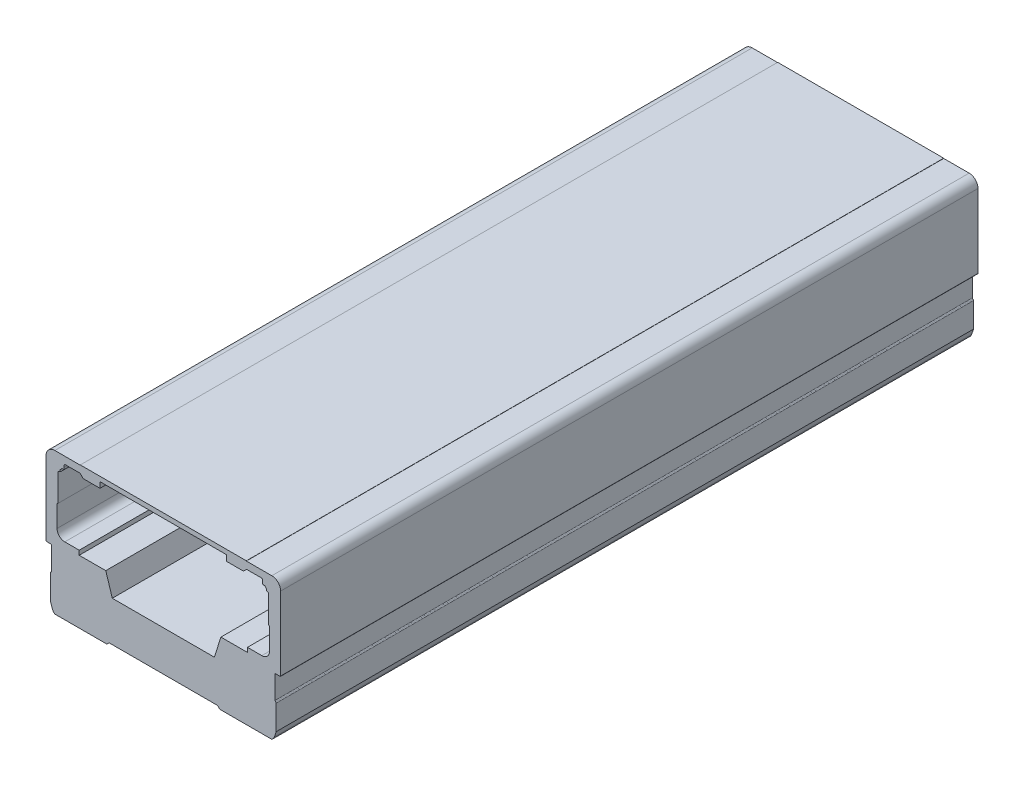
ISO-10303-21;
HEADER;
FILE_DESCRIPTION(('STEP AP214'),'2;1');
FILE_NAME('part.step','',(''),(''),'','','');
FILE_SCHEMA(('AUTOMOTIVE_DESIGN { 1 0 10303 214 1 1 1 1 }'));
ENDSEC;
DATA;
#1=APPLICATION_CONTEXT('core data for automotive mechanical design processes');
#2=APPLICATION_PROTOCOL_DEFINITION('international standard','automotive_design',2000,#1);
#3=PRODUCT_CONTEXT('',#1,'mechanical');
#4=PRODUCT('Part','Part','',(#3));
#5=PRODUCT_RELATED_PRODUCT_CATEGORY('part','',(#4));
#6=PRODUCT_DEFINITION_FORMATION('','',#4);
#7=PRODUCT_DEFINITION_CONTEXT('part definition',#1,'design');
#8=PRODUCT_DEFINITION('design','',#6,#7);
#9=PRODUCT_DEFINITION_SHAPE('','',#8);
#10=(LENGTH_UNIT() NAMED_UNIT(*) SI_UNIT(.MILLI.,.METRE.));
#11=(NAMED_UNIT(*) PLANE_ANGLE_UNIT() SI_UNIT($,.RADIAN.));
#12=(NAMED_UNIT(*) SI_UNIT($,.STERADIAN.) SOLID_ANGLE_UNIT());
#13=UNCERTAINTY_MEASURE_WITH_UNIT(LENGTH_MEASURE(1.E-05),#10,'distance_accuracy_value','');
#14=(GEOMETRIC_REPRESENTATION_CONTEXT(3) GLOBAL_UNCERTAINTY_ASSIGNED_CONTEXT((#13)) GLOBAL_UNIT_ASSIGNED_CONTEXT((#10,
#11,#12)) REPRESENTATION_CONTEXT('',''));
#15=CARTESIAN_POINT('',(0.,0.,0.));
#16=DIRECTION('',(0.,0.,1.));
#17=DIRECTION('',(1.,0.,0.));
#18=AXIS2_PLACEMENT_3D('',#15,#16,#17);
#19=CARTESIAN_POINT('',(-48.9999999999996,40.8371486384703,315.));
#20=DIRECTION('',(0.,0.,1.));
#21=DIRECTION('',(1.,0.,0.));
#22=AXIS2_PLACEMENT_3D('',#19,#20,#21);
#23=PLANE('',#22);
#24=DIRECTION('',(-1.,0.,0.));
#25=VECTOR('',#24,1.);
#26=CARTESIAN_POINT('',(49.0000000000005,44.8371486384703,315.));
#27=LINE('',#26,#25);
#28=CARTESIAN_POINT('',(49.0000000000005,44.8371486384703,315.));
#29=VERTEX_POINT('',#28);
#30=CARTESIAN_POINT('',(37.5000000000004,44.8371486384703,315.));
#31=VERTEX_POINT('',#30);
#32=EDGE_CURVE('E843',#29,#31,#27,.T.);
#33=ORIENTED_EDGE('',*,*,#32,.T.);
#34=DIRECTION('',(0.,1.,0.));
#35=VECTOR('',#34,1.);
#36=CARTESIAN_POINT('',(37.5000000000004,44.8371486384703,315.));
#37=LINE('',#36,#35);
#38=CARTESIAN_POINT('',(37.5000000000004,44.9371486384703,315.));
#39=VERTEX_POINT('',#38);
#40=EDGE_CURVE('E846',#31,#39,#37,.T.);
#41=ORIENTED_EDGE('',*,*,#40,.T.);
#42=DIRECTION('',(-1.,0.,0.));
#43=VECTOR('',#42,1.);
#44=CARTESIAN_POINT('',(37.5000000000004,44.9371486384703,315.));
#45=LINE('',#44,#43);
#46=CARTESIAN_POINT('',(-37.4999999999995,44.9371486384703,315.));
#47=VERTEX_POINT('',#46);
#48=EDGE_CURVE('E849',#39,#47,#45,.T.);
#49=ORIENTED_EDGE('',*,*,#48,.T.);
#50=DIRECTION('',(0.,-1.,0.));
#51=VECTOR('',#50,1.);
#52=CARTESIAN_POINT('',(-37.4999999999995,44.9371486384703,315.));
#53=LINE('',#52,#51);
#54=CARTESIAN_POINT('',(-37.4999999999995,44.8371486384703,315.));
#55=VERTEX_POINT('',#54);
#56=EDGE_CURVE('E851',#47,#55,#53,.T.);
#57=ORIENTED_EDGE('',*,*,#56,.T.);
#58=DIRECTION('',(-1.,0.,0.));
#59=VECTOR('',#58,1.);
#60=CARTESIAN_POINT('',(-37.4999999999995,44.8371486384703,315.));
#61=LINE('',#60,#59);
#62=CARTESIAN_POINT('',(-48.9999999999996,44.8371486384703,315.));
#63=VERTEX_POINT('',#62);
#64=EDGE_CURVE('E853',#55,#63,#61,.T.);
#65=ORIENTED_EDGE('',*,*,#64,.T.);
#66=CARTESIAN_POINT('',(-48.9999999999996,40.8371486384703,315.));
#67=DIRECTION('',(0.,0.,1.));
#68=DIRECTION('',(1.,0.,0.));
#69=AXIS2_PLACEMENT_3D('',#66,#67,#68);
#70=CIRCLE('',#69,4.);
#71=CARTESIAN_POINT('',(-52.9999999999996,40.8371486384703,315.));
#72=VERTEX_POINT('',#71);
#73=EDGE_CURVE('E855',#63,#72,#70,.T.);
#74=ORIENTED_EDGE('',*,*,#73,.T.);
#75=DIRECTION('',(0.,-1.,0.));
#76=VECTOR('',#75,1.);
#77=CARTESIAN_POINT('',(-52.9999999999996,40.8371486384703,315.));
#78=LINE('',#77,#76);
#79=CARTESIAN_POINT('',(-52.9999999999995,7.63714863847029,315.));
#80=VERTEX_POINT('',#79);
#81=EDGE_CURVE('E857',#72,#80,#78,.T.);
#82=ORIENTED_EDGE('',*,*,#81,.T.);
#83=CARTESIAN_POINT('',(-52.6999999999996,7.63714863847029,315.));
#84=DIRECTION('',(0.,0.,1.));
#85=DIRECTION('',(1.,0.,0.));
#86=AXIS2_PLACEMENT_3D('',#83,#84,#85);
#87=CIRCLE('',#86,0.299999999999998);
#88=CARTESIAN_POINT('',(-52.6999999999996,7.3371486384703,315.));
#89=VERTEX_POINT('',#88);
#90=EDGE_CURVE('E859',#80,#89,#87,.T.);
#91=ORIENTED_EDGE('',*,*,#90,.T.);
#92=DIRECTION('',(1.,0.,0.));
#93=VECTOR('',#92,1.);
#94=CARTESIAN_POINT('',(-52.6999999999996,7.33714863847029,315.));
#95=LINE('',#94,#93);
#96=CARTESIAN_POINT('',(-50.4999999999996,7.33714863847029,315.));
#97=VERTEX_POINT('',#96);
#98=EDGE_CURVE('E861',#89,#97,#95,.T.);
#99=ORIENTED_EDGE('',*,*,#98,.T.);
#100=DIRECTION('',(0.,-1.,0.));
#101=VECTOR('',#100,1.);
#102=CARTESIAN_POINT('',(-50.4999999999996,7.33714863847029,315.));
#103=LINE('',#102,#101);
#104=CARTESIAN_POINT('',(-50.4999999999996,-3.16285136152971,315.));
#105=VERTEX_POINT('',#104);
#106=EDGE_CURVE('E863',#97,#105,#103,.T.);
#107=ORIENTED_EDGE('',*,*,#106,.T.);
#108=CARTESIAN_POINT('',(-50.9999999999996,-3.16285136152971,315.));
#109=DIRECTION('',(0.,0.,-1.));
#110=DIRECTION('',(1.,0.,0.));
#111=AXIS2_PLACEMENT_3D('',#108,#109,#110);
#112=CIRCLE('',#111,0.49999999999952);
#113=CARTESIAN_POINT('',(-50.7499999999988,-3.59586406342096,315.));
#114=VERTEX_POINT('',#113);
#115=EDGE_CURVE('E865',#105,#114,#112,.T.);
#116=ORIENTED_EDGE('',*,*,#115,.T.);
#117=CARTESIAN_POINT('',(-50.4999999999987,-4.02887676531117,315.));
#118=DIRECTION('',(0.,0.,1.));
#119=DIRECTION('',(1.,0.,0.));
#120=AXIS2_PLACEMENT_3D('',#117,#118,#119);
#121=CIRCLE('',#120,0.499999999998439);
#122=CARTESIAN_POINT('',(-50.9999999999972,-4.02887676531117,315.));
#123=VERTEX_POINT('',#122);
#124=EDGE_CURVE('E867',#114,#123,#121,.T.);
#125=ORIENTED_EDGE('',*,*,#124,.T.);
#126=DIRECTION('',(0.,-1.,0.));
#127=VECTOR('',#126,1.);
#128=CARTESIAN_POINT('',(-50.9999999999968,-4.02887676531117,315.));
#129=LINE('',#128,#127);
#130=CARTESIAN_POINT('',(-50.9999999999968,-15.1628513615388,315.));
#131=VERTEX_POINT('',#130);
#132=EDGE_CURVE('E869',#123,#131,#129,.T.);
#133=ORIENTED_EDGE('',*,*,#132,.T.);
#134=DIRECTION('',(0.325568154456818,-0.945518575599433,0.));
#135=VECTOR('',#134,1.);
#136=CARTESIAN_POINT('',(-50.9999999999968,-15.1628513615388,315.));
#137=LINE('',#136,#135);
#138=CARTESIAN_POINT('',(-50.1378012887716,-17.6668582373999,315.));
#139=VERTEX_POINT('',#138);
#140=EDGE_CURVE('E871',#131,#139,#137,.T.);
#141=ORIENTED_EDGE('',*,*,#140,.T.);
#142=CARTESIAN_POINT('',(-47.3012455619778,-16.6901537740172,315.));
#143=DIRECTION('',(0.,0.,1.));
#144=DIRECTION('',(1.,0.,0.));
#145=AXIS2_PLACEMENT_3D('',#142,#143,#144);
#146=CIRCLE('',#145,2.99999999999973);
#147=CARTESIAN_POINT('',(-48.9999999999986,-19.1628513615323,315.));
#148=VERTEX_POINT('',#147);
#149=EDGE_CURVE('E873',#139,#148,#146,.T.);
#150=ORIENTED_EDGE('',*,*,#149,.T.);
#151=DIRECTION('',(1.,0.,0.));
#152=VECTOR('',#151,1.);
#153=CARTESIAN_POINT('',(-48.9999999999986,-19.1628513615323,315.));
#154=LINE('',#153,#152);
#155=CARTESIAN_POINT('',(-25.4999999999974,-19.1628513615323,315.));
#156=VERTEX_POINT('',#155);
#157=EDGE_CURVE('E875',#148,#156,#154,.T.);
#158=ORIENTED_EDGE('',*,*,#157,.T.);
#159=DIRECTION('',(0.707106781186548,0.707106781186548,0.));
#160=VECTOR('',#159,1.);
#161=CARTESIAN_POINT('',(-25.4999999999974,-19.1628513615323,315.));
#162=LINE('',#161,#160);
#163=CARTESIAN_POINT('',(-24.4999999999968,-18.1628513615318,315.));
#164=VERTEX_POINT('',#163);
#165=EDGE_CURVE('E877',#156,#164,#162,.T.);
#166=ORIENTED_EDGE('',*,*,#165,.T.);
#167=DIRECTION('',(1.,0.,0.));
#168=VECTOR('',#167,1.);
#169=CARTESIAN_POINT('',(-24.4999999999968,-18.1628513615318,315.));
#170=LINE('',#169,#168);
#171=CARTESIAN_POINT('',(24.5000000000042,-18.1628513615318,315.));
#172=VERTEX_POINT('',#171);
#173=EDGE_CURVE('E879',#164,#172,#170,.T.);
#174=ORIENTED_EDGE('',*,*,#173,.T.);
#175=DIRECTION('',(0.707106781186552,-0.707106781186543,0.));
#176=VECTOR('',#175,1.);
#177=CARTESIAN_POINT('',(24.5000000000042,-18.1628513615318,315.));
#178=LINE('',#177,#176);
#179=CARTESIAN_POINT('',(25.5000000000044,-19.162851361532,315.));
#180=VERTEX_POINT('',#179);
#181=EDGE_CURVE('E881',#172,#180,#178,.T.);
#182=ORIENTED_EDGE('',*,*,#181,.T.);
#183=DIRECTION('',(1.,0.,0.));
#184=VECTOR('',#183,1.);
#185=CARTESIAN_POINT('',(25.5000000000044,-19.162851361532,315.));
#186=LINE('',#185,#184);
#187=CARTESIAN_POINT('',(49.0000000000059,-19.162851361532,315.));
#188=VERTEX_POINT('',#187);
#189=EDGE_CURVE('E883',#180,#188,#186,.T.);
#190=ORIENTED_EDGE('',*,*,#189,.T.);
#191=CARTESIAN_POINT('',(47.3012453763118,-16.6901535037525,315.));
#192=DIRECTION('',(0.,0.,1.));
#193=DIRECTION('',(1.,0.,0.));
#194=AXIS2_PLACEMENT_3D('',#191,#192,#193);
#195=CIRCLE('',#194,3.0000003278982);
#196=CARTESIAN_POINT('',(50.1365073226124,-17.6706083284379,315.));
#197=VERTEX_POINT('',#196);
#198=EDGE_CURVE('E885',#188,#197,#195,.T.);
#199=ORIENTED_EDGE('',*,*,#198,.T.);
#200=DIRECTION('',(0.325568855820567,0.945518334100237,0.));
#201=VECTOR('',#200,1.);
#202=CARTESIAN_POINT('',(50.1365073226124,-17.6706083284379,315.));
#203=LINE('',#202,#201);
#204=CARTESIAN_POINT('',(50.9999995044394,-15.1628509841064,315.));
#205=VERTEX_POINT('',#204);
#206=EDGE_CURVE('E887',#197,#205,#203,.T.);
#207=ORIENTED_EDGE('',*,*,#206,.T.);
#208=DIRECTION('',(0.,1.,0.));
#209=VECTOR('',#208,1.);
#210=CARTESIAN_POINT('',(50.9999995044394,-15.1628509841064,315.));
#211=LINE('',#210,#209);
#212=CARTESIAN_POINT('',(50.9999995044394,-4.02887638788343,315.));
#213=VERTEX_POINT('',#212);
#214=EDGE_CURVE('E889',#205,#213,#211,.T.);
#215=ORIENTED_EDGE('',*,*,#214,.T.);
#216=CARTESIAN_POINT('',(50.4999995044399,-4.02887638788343,315.));
#217=DIRECTION('',(0.,0.,1.));
#218=DIRECTION('',(1.,0.,0.));
#219=AXIS2_PLACEMENT_3D('',#216,#217,#218);
#220=CIRCLE('',#219,0.499999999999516);
#221=CARTESIAN_POINT('',(50.7499995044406,-3.59586368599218,315.));
#222=VERTEX_POINT('',#221);
#223=EDGE_CURVE('E891',#213,#222,#220,.T.);
#224=ORIENTED_EDGE('',*,*,#223,.T.);
#225=CARTESIAN_POINT('',(50.9999995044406,-3.16285098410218,315.));
#226=DIRECTION('',(0.,0.,-1.));
#227=DIRECTION('',(1.,0.,0.));
#228=AXIS2_PLACEMENT_3D('',#225,#226,#227);
#229=CIRCLE('',#228,0.499999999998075);
#230=CARTESIAN_POINT('',(50.4999995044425,-3.16285098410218,315.));
#231=VERTEX_POINT('',#230);
#232=EDGE_CURVE('E893',#222,#231,#229,.T.);
#233=ORIENTED_EDGE('',*,*,#232,.T.);
#234=DIRECTION('',(0.,1.,0.));
#235=VECTOR('',#234,1.);
#236=CARTESIAN_POINT('',(50.4999995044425,-3.16285098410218,315.));
#237=LINE('',#236,#235);
#238=CARTESIAN_POINT('',(50.4999995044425,7.33714863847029,315.));
#239=VERTEX_POINT('',#238);
#240=EDGE_CURVE('E895',#231,#239,#237,.T.);
#241=ORIENTED_EDGE('',*,*,#240,.T.);
#242=DIRECTION('',(1.,0.,0.));
#243=VECTOR('',#242,1.);
#244=CARTESIAN_POINT('',(50.4999995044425,7.33714863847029,315.));
#245=LINE('',#244,#243);
#246=CARTESIAN_POINT('',(52.7000000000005,7.33714863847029,315.));
#247=VERTEX_POINT('',#246);
#248=EDGE_CURVE('E897',#239,#247,#245,.T.);
#249=ORIENTED_EDGE('',*,*,#248,.T.);
#250=CARTESIAN_POINT('',(52.7000000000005,7.63714863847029,315.));
#251=DIRECTION('',(0.,0.,1.));
#252=DIRECTION('',(1.,0.,0.));
#253=AXIS2_PLACEMENT_3D('',#250,#251,#252);
#254=CIRCLE('',#253,0.300000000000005);
#255=CARTESIAN_POINT('',(53.0000000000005,7.63714863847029,315.));
#256=VERTEX_POINT('',#255);
#257=EDGE_CURVE('E899',#247,#256,#254,.T.);
#258=ORIENTED_EDGE('',*,*,#257,.T.);
#259=DIRECTION('',(0.,1.,0.));
#260=VECTOR('',#259,1.);
#261=CARTESIAN_POINT('',(53.0000000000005,7.63714863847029,315.));
#262=LINE('',#261,#260);
#263=CARTESIAN_POINT('',(53.0000000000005,40.8371486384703,315.));
#264=VERTEX_POINT('',#263);
#265=EDGE_CURVE('E901',#256,#264,#262,.T.);
#266=ORIENTED_EDGE('',*,*,#265,.T.);
#267=CARTESIAN_POINT('',(49.0000000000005,40.8371486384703,315.));
#268=DIRECTION('',(0.,0.,1.));
#269=DIRECTION('',(1.,0.,0.));
#270=AXIS2_PLACEMENT_3D('',#267,#268,#269);
#271=CIRCLE('',#270,4.);
#272=EDGE_CURVE('E903',#264,#29,#271,.T.);
#273=ORIENTED_EDGE('',*,*,#272,.T.);
#274=EDGE_LOOP('',(#33,#41,#49,#57,#65,#74,#82,#91,#99,#107,#116,#125,#133,#141,#150,#158,#166,
#174,#182,#190,#199,#207,#215,#224,#233,#241,#249,#258,#266,#273));
#275=FACE_BOUND('',#274,.T.);
#276=CARTESIAN_POINT('',(-44.4999999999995,14.8371486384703,315.));
#277=DIRECTION('',(0.,0.,1.));
#278=DIRECTION('',(1.,0.,0.));
#279=AXIS2_PLACEMENT_3D('',#276,#277,#278);
#280=CIRCLE('',#279,3.5);
#281=CARTESIAN_POINT('',(-47.9999999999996,14.8371486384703,315.));
#282=VERTEX_POINT('',#281);
#283=CARTESIAN_POINT('',(-44.4999999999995,11.3371486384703,315.));
#284=VERTEX_POINT('',#283);
#285=EDGE_CURVE('E553',#282,#284,#280,.T.);
#286=ORIENTED_EDGE('',*,*,#285,.F.);
#287=DIRECTION('',(0.,-1.,0.));
#288=VECTOR('',#287,1.);
#289=CARTESIAN_POINT('',(-47.9999999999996,24.5371486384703,315.));
#290=LINE('',#289,#288);
#291=CARTESIAN_POINT('',(-47.9999999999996,24.5371486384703,315.));
#292=VERTEX_POINT('',#291);
#293=EDGE_CURVE('E551',#292,#282,#290,.T.);
#294=ORIENTED_EDGE('',*,*,#293,.F.);
#295=DIRECTION('',(-0.799999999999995,-0.600000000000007,0.));
#296=VECTOR('',#295,1.);
#297=CARTESIAN_POINT('',(-47.5999999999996,24.8371486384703,315.));
#298=LINE('',#297,#296);
#299=CARTESIAN_POINT('',(-47.5999999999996,24.8371486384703,315.));
#300=VERTEX_POINT('',#299);
#301=EDGE_CURVE('E634',#300,#292,#298,.T.);
#302=ORIENTED_EDGE('',*,*,#301,.F.);
#303=DIRECTION('',(0.,-1.,0.));
#304=VECTOR('',#303,1.);
#305=CARTESIAN_POINT('',(-47.5999999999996,37.0752473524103,315.));
#306=LINE('',#305,#304);
#307=CARTESIAN_POINT('',(-47.5999999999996,37.0752473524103,315.));
#308=VERTEX_POINT('',#307);
#309=EDGE_CURVE('E632',#308,#300,#306,.T.);
#310=ORIENTED_EDGE('',*,*,#309,.F.);
#311=CARTESIAN_POINT('',(-47.0999999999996,37.0752473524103,315.));
#312=DIRECTION('',(0.,0.,1.));
#313=DIRECTION('',(1.,0.,0.));
#314=AXIS2_PLACEMENT_3D('',#311,#312,#313);
#315=CIRCLE('',#314,0.500000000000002);
#316=CARTESIAN_POINT('',(-47.1757575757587,37.5694748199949,315.));
#317=VERTEX_POINT('',#316);
#318=EDGE_CURVE('E630',#317,#308,#315,.T.);
#319=ORIENTED_EDGE('',*,*,#318,.F.);
#320=CARTESIAN_POINT('',(-47.5999999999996,40.3371486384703,315.));
#321=DIRECTION('',(0.,0.,-1.));
#322=DIRECTION('',(1.,0.,0.));
#323=AXIS2_PLACEMENT_3D('',#320,#321,#322);
#324=CIRCLE('',#323,2.79999999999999);
#325=CARTESIAN_POINT('',(-46.4577825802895,37.7807176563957,315.));
#326=VERTEX_POINT('',#325);
#327=EDGE_CURVE('E628',#326,#317,#324,.T.);
#328=ORIENTED_EDGE('',*,*,#327,.F.);
#329=DIRECTION('',(0.349665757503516,-0.936874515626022,0.));
#330=VECTOR('',#329,1.);
#331=CARTESIAN_POINT('',(-46.7382941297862,38.5323043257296,315.));
#332=LINE('',#331,#330);
#333=CARTESIAN_POINT('',(-46.7382941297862,38.5323043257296,315.));
#334=VERTEX_POINT('',#333);
#335=EDGE_CURVE('E626',#334,#326,#332,.T.);
#336=ORIENTED_EDGE('',*,*,#335,.F.);
#337=CARTESIAN_POINT('',(-47.5999999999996,40.3371486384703,315.));
#338=DIRECTION('',(0.,0.,-1.));
#339=DIRECTION('',(1.,0.,0.));
#340=AXIS2_PLACEMENT_3D('',#337,#338,#339);
#341=CIRCLE('',#340,1.99999999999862);
#342=CARTESIAN_POINT('',(-45.7951556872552,39.4754427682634,315.));
#343=VERTEX_POINT('',#342);
#344=EDGE_CURVE('E624',#343,#334,#341,.T.);
#345=ORIENTED_EDGE('',*,*,#344,.F.);
#346=DIRECTION('',(-0.936874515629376,0.349665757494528,0.));
#347=VECTOR('',#346,1.);
#348=CARTESIAN_POINT('',(-45.0435690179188,39.194931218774,315.));
#349=LINE('',#348,#347);
#350=CARTESIAN_POINT('',(-45.0435690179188,39.194931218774,315.));
#351=VERTEX_POINT('',#350);
#352=EDGE_CURVE('E622',#351,#343,#349,.T.);
#353=ORIENTED_EDGE('',*,*,#352,.F.);
#354=CARTESIAN_POINT('',(-47.5999999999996,40.3371486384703,315.));
#355=DIRECTION('',(0.,0.,-1.));
#356=DIRECTION('',(1.,0.,0.));
#357=AXIS2_PLACEMENT_3D('',#354,#355,#356);
#358=CIRCLE('',#357,2.8);
#359=CARTESIAN_POINT('',(-44.7999999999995,40.3371486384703,315.));
#360=VERTEX_POINT('',#359);
#361=EDGE_CURVE('E620',#360,#351,#358,.T.);
#362=ORIENTED_EDGE('',*,*,#361,.F.);
#363=DIRECTION('',(0.,-1.,0.));
#364=VECTOR('',#363,1.);
#365=CARTESIAN_POINT('',(-44.7999999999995,41.1371486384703,315.));
#366=LINE('',#365,#364);
#367=CARTESIAN_POINT('',(-44.7999999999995,41.1371486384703,315.));
#368=VERTEX_POINT('',#367);
#369=EDGE_CURVE('E618',#368,#360,#366,.T.);
#370=ORIENTED_EDGE('',*,*,#369,.F.);
#371=CARTESIAN_POINT('',(-44.2999999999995,41.1371486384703,315.));
#372=DIRECTION('',(0.,0.,1.));
#373=DIRECTION('',(1.,0.,0.));
#374=AXIS2_PLACEMENT_3D('',#371,#372,#373);
#375=CIRCLE('',#374,0.5);
#376=CARTESIAN_POINT('',(-44.2999999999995,41.6371486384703,315.));
#377=VERTEX_POINT('',#376);
#378=EDGE_CURVE('E616',#377,#368,#375,.T.);
#379=ORIENTED_EDGE('',*,*,#378,.F.);
#380=DIRECTION('',(-1.,0.,0.));
#381=VECTOR('',#380,1.);
#382=CARTESIAN_POINT('',(-37.5999999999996,41.6371486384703,315.));
#383=LINE('',#382,#381);
#384=CARTESIAN_POINT('',(-37.5999999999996,41.6371486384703,315.));
#385=VERTEX_POINT('',#384);
#386=EDGE_CURVE('E614',#385,#377,#383,.T.);
#387=ORIENTED_EDGE('',*,*,#386,.F.);
#388=DIRECTION('',(-0.707106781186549,0.707106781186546,0.));
#389=VECTOR('',#388,1.);
#390=CARTESIAN_POINT('',(-36.1999999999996,40.2371486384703,315.));
#391=LINE('',#390,#389);
#392=CARTESIAN_POINT('',(-36.1999999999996,40.2371486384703,315.));
#393=VERTEX_POINT('',#392);
#394=EDGE_CURVE('E612',#393,#385,#391,.T.);
#395=ORIENTED_EDGE('',*,*,#394,.F.);
#396=DIRECTION('',(-1.,0.,0.));
#397=VECTOR('',#396,1.);
#398=CARTESIAN_POINT('',(-28.5999999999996,40.2371486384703,315.));
#399=LINE('',#398,#397);
#400=CARTESIAN_POINT('',(-28.5999999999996,40.2371486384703,315.));
#401=VERTEX_POINT('',#400);
#402=EDGE_CURVE('E610',#401,#393,#399,.T.);
#403=ORIENTED_EDGE('',*,*,#402,.F.);
#404=DIRECTION('',(0.,-1.,0.));
#405=VECTOR('',#404,1.);
#406=CARTESIAN_POINT('',(-28.5999999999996,42.8371486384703,315.));
#407=LINE('',#406,#405);
#408=CARTESIAN_POINT('',(-28.5999999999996,42.8371486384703,315.));
#409=VERTEX_POINT('',#408);
#410=EDGE_CURVE('E608',#409,#401,#407,.T.);
#411=ORIENTED_EDGE('',*,*,#410,.F.);
#412=DIRECTION('',(-1.,0.,0.));
#413=VECTOR('',#412,1.);
#414=CARTESIAN_POINT('',(28.6000000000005,42.8371486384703,315.));
#415=LINE('',#414,#413);
#416=CARTESIAN_POINT('',(28.6000000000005,42.8371486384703,315.));
#417=VERTEX_POINT('',#416);
#418=EDGE_CURVE('E606',#417,#409,#415,.T.);
#419=ORIENTED_EDGE('',*,*,#418,.F.);
#420=DIRECTION('',(0.,1.,0.));
#421=VECTOR('',#420,1.);
#422=CARTESIAN_POINT('',(28.6000000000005,40.2371486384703,315.));
#423=LINE('',#422,#421);
#424=CARTESIAN_POINT('',(28.6000000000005,40.2371486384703,315.));
#425=VERTEX_POINT('',#424);
#426=EDGE_CURVE('E604',#425,#417,#423,.T.);
#427=ORIENTED_EDGE('',*,*,#426,.F.);
#428=DIRECTION('',(-1.,0.,0.));
#429=VECTOR('',#428,1.);
#430=CARTESIAN_POINT('',(36.2000000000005,40.2371486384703,315.));
#431=LINE('',#430,#429);
#432=CARTESIAN_POINT('',(36.2000000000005,40.2371486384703,315.));
#433=VERTEX_POINT('',#432);
#434=EDGE_CURVE('E602',#433,#425,#431,.T.);
#435=ORIENTED_EDGE('',*,*,#434,.F.);
#436=DIRECTION('',(-0.707106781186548,-0.707106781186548,0.));
#437=VECTOR('',#436,1.);
#438=CARTESIAN_POINT('',(37.6000000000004,41.6371486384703,315.));
#439=LINE('',#438,#437);
#440=CARTESIAN_POINT('',(37.6000000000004,41.6371486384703,315.));
#441=VERTEX_POINT('',#440);
#442=EDGE_CURVE('E600',#441,#433,#439,.T.);
#443=ORIENTED_EDGE('',*,*,#442,.F.);
#444=DIRECTION('',(-1.,0.,0.));
#445=VECTOR('',#444,1.);
#446=CARTESIAN_POINT('',(44.3000000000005,41.6371486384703,315.));
#447=LINE('',#446,#445);
#448=CARTESIAN_POINT('',(44.3000000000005,41.6371486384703,315.));
#449=VERTEX_POINT('',#448);
#450=EDGE_CURVE('E598',#449,#441,#447,.T.);
#451=ORIENTED_EDGE('',*,*,#450,.F.);
#452=CARTESIAN_POINT('',(44.3000000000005,41.1371486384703,315.));
#453=DIRECTION('',(0.,0.,1.));
#454=DIRECTION('',(1.,0.,0.));
#455=AXIS2_PLACEMENT_3D('',#452,#453,#454);
#456=CIRCLE('',#455,0.5);
#457=CARTESIAN_POINT('',(44.8000000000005,41.1371486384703,315.));
#458=VERTEX_POINT('',#457);
#459=EDGE_CURVE('E596',#458,#449,#456,.T.);
#460=ORIENTED_EDGE('',*,*,#459,.F.);
#461=DIRECTION('',(0.,1.,0.));
#462=VECTOR('',#461,1.);
#463=CARTESIAN_POINT('',(44.8000000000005,40.3371486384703,315.));
#464=LINE('',#463,#462);
#465=CARTESIAN_POINT('',(44.8000000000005,40.3371486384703,315.));
#466=VERTEX_POINT('',#465);
#467=EDGE_CURVE('E594',#466,#458,#464,.T.);
#468=ORIENTED_EDGE('',*,*,#467,.F.);
#469=CARTESIAN_POINT('',(47.6000000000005,40.3371486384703,315.));
#470=DIRECTION('',(0.,0.,-1.));
#471=DIRECTION('',(1.,0.,0.));
#472=AXIS2_PLACEMENT_3D('',#469,#470,#471);
#473=CIRCLE('',#472,2.8);
#474=CARTESIAN_POINT('',(45.0435690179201,39.1949312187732,315.));
#475=VERTEX_POINT('',#474);
#476=EDGE_CURVE('E592',#475,#466,#473,.T.);
#477=ORIENTED_EDGE('',*,*,#476,.F.);
#478=DIRECTION('',(-0.936874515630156,-0.349665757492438,0.));
#479=VECTOR('',#478,1.);
#480=CARTESIAN_POINT('',(45.795155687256,39.4754427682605,315.));
#481=LINE('',#480,#479);
#482=CARTESIAN_POINT('',(45.795155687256,39.4754427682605,315.));
#483=VERTEX_POINT('',#482);
#484=EDGE_CURVE('E590',#483,#475,#481,.T.);
#485=ORIENTED_EDGE('',*,*,#484,.F.);
#486=CARTESIAN_POINT('',(47.6000000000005,40.3371486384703,315.));
#487=DIRECTION('',(0.,0.,-1.));
#488=DIRECTION('',(1.,0.,0.));
#489=AXIS2_PLACEMENT_3D('',#486,#487,#488);
#490=CIRCLE('',#489,1.9999999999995);
#491=CARTESIAN_POINT('',(46.7382941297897,38.5323043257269,315.));
#492=VERTEX_POINT('',#491);
#493=EDGE_CURVE('E588',#492,#483,#490,.T.);
#494=ORIENTED_EDGE('',*,*,#493,.F.);
#495=DIRECTION('',(0.349665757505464,0.936874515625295,0.));
#496=VECTOR('',#495,1.);
#497=CARTESIAN_POINT('',(46.457782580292,37.780717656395,315.));
#498=LINE('',#497,#496);
#499=CARTESIAN_POINT('',(46.457782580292,37.780717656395,315.));
#500=VERTEX_POINT('',#499);
#501=EDGE_CURVE('E586',#500,#492,#498,.T.);
#502=ORIENTED_EDGE('',*,*,#501,.F.);
#503=CARTESIAN_POINT('',(47.6000000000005,40.3371486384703,315.));
#504=DIRECTION('',(0.,0.,-1.));
#505=DIRECTION('',(1.,0.,0.));
#506=AXIS2_PLACEMENT_3D('',#503,#504,#505);
#507=CIRCLE('',#506,2.8);
#508=CARTESIAN_POINT('',(47.1757575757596,37.5694748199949,315.));
#509=VERTEX_POINT('',#508);
#510=EDGE_CURVE('E584',#509,#500,#507,.T.);
#511=ORIENTED_EDGE('',*,*,#510,.F.);
#512=CARTESIAN_POINT('',(47.1000000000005,37.0752473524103,315.));
#513=DIRECTION('',(0.,0.,1.));
#514=DIRECTION('',(1.,0.,0.));
#515=AXIS2_PLACEMENT_3D('',#512,#513,#514);
#516=CIRCLE('',#515,0.499999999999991);
#517=CARTESIAN_POINT('',(47.6000000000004,37.0752473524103,315.));
#518=VERTEX_POINT('',#517);
#519=EDGE_CURVE('E582',#518,#509,#516,.T.);
#520=ORIENTED_EDGE('',*,*,#519,.F.);
#521=DIRECTION('',(0.,1.,0.));
#522=VECTOR('',#521,1.);
#523=CARTESIAN_POINT('',(47.6000000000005,24.8371486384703,315.));
#524=LINE('',#523,#522);
#525=CARTESIAN_POINT('',(47.6000000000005,24.8371486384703,315.));
#526=VERTEX_POINT('',#525);
#527=EDGE_CURVE('E580',#526,#518,#524,.T.);
#528=ORIENTED_EDGE('',*,*,#527,.F.);
#529=DIRECTION('',(-0.799999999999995,0.600000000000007,0.));
#530=VECTOR('',#529,1.);
#531=CARTESIAN_POINT('',(48.0000000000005,24.5371486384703,315.));
#532=LINE('',#531,#530);
#533=CARTESIAN_POINT('',(48.0000000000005,24.5371486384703,315.));
#534=VERTEX_POINT('',#533);
#535=EDGE_CURVE('E578',#534,#526,#532,.T.);
#536=ORIENTED_EDGE('',*,*,#535,.F.);
#537=DIRECTION('',(0.,1.,0.));
#538=VECTOR('',#537,1.);
#539=CARTESIAN_POINT('',(48.0000000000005,14.8371486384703,315.));
#540=LINE('',#539,#538);
#541=CARTESIAN_POINT('',(48.0000000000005,14.8371486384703,315.));
#542=VERTEX_POINT('',#541);
#543=EDGE_CURVE('E576',#542,#534,#540,.T.);
#544=ORIENTED_EDGE('',*,*,#543,.F.);
#545=CARTESIAN_POINT('',(44.5000000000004,14.8371486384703,315.));
#546=DIRECTION('',(0.,0.,1.));
#547=DIRECTION('',(1.,0.,0.));
#548=AXIS2_PLACEMENT_3D('',#545,#546,#547);
#549=CIRCLE('',#548,3.5);
#550=CARTESIAN_POINT('',(44.5000000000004,11.3371486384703,315.));
#551=VERTEX_POINT('',#550);
#552=EDGE_CURVE('E574',#551,#542,#549,.T.);
#553=ORIENTED_EDGE('',*,*,#552,.F.);
#554=DIRECTION('',(1.,0.,0.));
#555=VECTOR('',#554,1.);
#556=CARTESIAN_POINT('',(38.0000000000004,11.3371486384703,315.));
#557=LINE('',#556,#555);
#558=CARTESIAN_POINT('',(38.0000000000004,11.3371486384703,315.));
#559=VERTEX_POINT('',#558);
#560=EDGE_CURVE('E572',#559,#551,#557,.T.);
#561=ORIENTED_EDGE('',*,*,#560,.F.);
#562=DIRECTION('',(0.,1.,0.));
#563=VECTOR('',#562,1.);
#564=CARTESIAN_POINT('',(38.0000000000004,9.33714863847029,315.));
#565=LINE('',#564,#563);
#566=CARTESIAN_POINT('',(38.0000000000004,9.33714863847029,315.));
#567=VERTEX_POINT('',#566);
#568=EDGE_CURVE('E570',#567,#559,#565,.T.);
#569=ORIENTED_EDGE('',*,*,#568,.F.);
#570=DIRECTION('',(1.,0.,0.));
#571=VECTOR('',#570,1.);
#572=CARTESIAN_POINT('',(26.0000000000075,9.33714863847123,315.));
#573=LINE('',#572,#571);
#574=CARTESIAN_POINT('',(26.0000000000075,9.33714863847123,315.));
#575=VERTEX_POINT('',#574);
#576=EDGE_CURVE('E568',#575,#567,#573,.T.);
#577=ORIENTED_EDGE('',*,*,#576,.F.);
#578=DIRECTION('',(0.300705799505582,0.953716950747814,0.));
#579=VECTOR('',#578,1.);
#580=CARTESIAN_POINT('',(23.0560083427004,2.84494650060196E-13,315.));
#581=LINE('',#580,#579);
#582=CARTESIAN_POINT('',(23.0560083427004,2.84494650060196E-13,315.));
#583=VERTEX_POINT('',#582);
#584=EDGE_CURVE('E566',#583,#575,#581,.T.);
#585=ORIENTED_EDGE('',*,*,#584,.F.);
#586=DIRECTION('',(1.,0.,0.));
#587=VECTOR('',#586,1.);
#588=CARTESIAN_POINT('',(-23.0560083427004,0.,315.));
#589=LINE('',#588,#587);
#590=CARTESIAN_POINT('',(-23.0560083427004,0.,315.));
#591=VERTEX_POINT('',#590);
#592=EDGE_CURVE('E564',#591,#583,#589,.T.);
#593=ORIENTED_EDGE('',*,*,#592,.F.);
#594=DIRECTION('',(0.300705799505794,-0.953716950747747,0.));
#595=VECTOR('',#594,1.);
#596=CARTESIAN_POINT('',(-26.0000000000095,9.33714863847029,315.));
#597=LINE('',#596,#595);
#598=CARTESIAN_POINT('',(-26.0000000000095,9.33714863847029,315.));
#599=VERTEX_POINT('',#598);
#600=EDGE_CURVE('E562',#599,#591,#597,.T.);
#601=ORIENTED_EDGE('',*,*,#600,.F.);
#602=DIRECTION('',(1.,0.,0.));
#603=VECTOR('',#602,1.);
#604=CARTESIAN_POINT('',(-37.9999999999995,9.33714863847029,315.));
#605=LINE('',#604,#603);
#606=CARTESIAN_POINT('',(-37.9999999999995,9.33714863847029,315.));
#607=VERTEX_POINT('',#606);
#608=EDGE_CURVE('E560',#607,#599,#605,.T.);
#609=ORIENTED_EDGE('',*,*,#608,.F.);
#610=DIRECTION('',(0.,-1.,0.));
#611=VECTOR('',#610,1.);
#612=CARTESIAN_POINT('',(-37.9999999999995,11.3371486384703,315.));
#613=LINE('',#612,#611);
#614=CARTESIAN_POINT('',(-37.9999999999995,11.3371486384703,315.));
#615=VERTEX_POINT('',#614);
#616=EDGE_CURVE('E558',#615,#607,#613,.T.);
#617=ORIENTED_EDGE('',*,*,#616,.F.);
#618=DIRECTION('',(1.,0.,0.));
#619=VECTOR('',#618,1.);
#620=CARTESIAN_POINT('',(-44.4999999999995,11.3371486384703,315.));
#621=LINE('',#620,#619);
#622=EDGE_CURVE('E556',#284,#615,#621,.T.);
#623=ORIENTED_EDGE('',*,*,#622,.F.);
#624=EDGE_LOOP('',(#286,#294,#302,#310,#319,#328,#336,#345,#353,#362,#370,#379,#387,#395,#403,
#411,#419,#427,#435,#443,#451,#460,#468,#477,#485,#494,#502,#511,#520,#528,#536,#544,#553,#561,
#569,#577,#585,#593,#601,#609,#617,#623));
#625=FACE_BOUND('',#624,.T.);
#626=ADVANCED_FACE('F39',(#275,#625),#23,.T.);
#627=CARTESIAN_POINT('',(-48.9999999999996,40.8371486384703,0.));
#628=DIRECTION('',(0.,0.,1.));
#629=DIRECTION('',(1.,0.,0.));
#630=AXIS2_PLACEMENT_3D('',#627,#628,#629);
#631=PLANE('',#630);
#632=DIRECTION('',(-1.,0.,0.));
#633=VECTOR('',#632,1.);
#634=CARTESIAN_POINT('',(49.0000000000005,44.8371486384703,0.));
#635=LINE('',#634,#633);
#636=CARTESIAN_POINT('',(49.0000000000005,44.8371486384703,0.));
#637=VERTEX_POINT('',#636);
#638=CARTESIAN_POINT('',(37.5000000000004,44.8371486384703,0.));
#639=VERTEX_POINT('',#638);
#640=EDGE_CURVE('E842',#637,#639,#635,.T.);
#641=ORIENTED_EDGE('',*,*,#640,.F.);
#642=CARTESIAN_POINT('',(49.0000000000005,40.8371486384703,0.));
#643=DIRECTION('',(0.,0.,1.));
#644=DIRECTION('',(1.,0.,0.));
#645=AXIS2_PLACEMENT_3D('',#642,#643,#644);
#646=CIRCLE('',#645,4.);
#647=CARTESIAN_POINT('',(53.0000000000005,40.8371486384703,0.));
#648=VERTEX_POINT('',#647);
#649=EDGE_CURVE('E847',#648,#637,#646,.T.);
#650=ORIENTED_EDGE('',*,*,#649,.F.);
#651=DIRECTION('',(0.,1.,0.));
#652=VECTOR('',#651,1.);
#653=CARTESIAN_POINT('',(53.0000000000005,7.63714863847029,0.));
#654=LINE('',#653,#652);
#655=CARTESIAN_POINT('',(53.0000000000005,7.63714863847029,0.));
#656=VERTEX_POINT('',#655);
#657=EDGE_CURVE('E962',#656,#648,#654,.T.);
#658=ORIENTED_EDGE('',*,*,#657,.F.);
#659=CARTESIAN_POINT('',(52.7000000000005,7.63714863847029,0.));
#660=DIRECTION('',(0.,0.,1.));
#661=DIRECTION('',(1.,0.,0.));
#662=AXIS2_PLACEMENT_3D('',#659,#660,#661);
#663=CIRCLE('',#662,0.300000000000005);
#664=CARTESIAN_POINT('',(52.7000000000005,7.33714863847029,0.));
#665=VERTEX_POINT('',#664);
#666=EDGE_CURVE('E960',#665,#656,#663,.T.);
#667=ORIENTED_EDGE('',*,*,#666,.F.);
#668=DIRECTION('',(1.,0.,0.));
#669=VECTOR('',#668,1.);
#670=CARTESIAN_POINT('',(50.4999995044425,7.33714863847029,0.));
#671=LINE('',#670,#669);
#672=CARTESIAN_POINT('',(50.4999995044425,7.33714863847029,0.));
#673=VERTEX_POINT('',#672);
#674=EDGE_CURVE('E958',#673,#665,#671,.T.);
#675=ORIENTED_EDGE('',*,*,#674,.F.);
#676=DIRECTION('',(0.,1.,0.));
#677=VECTOR('',#676,1.);
#678=CARTESIAN_POINT('',(50.4999995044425,-3.16285098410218,0.));
#679=LINE('',#678,#677);
#680=CARTESIAN_POINT('',(50.4999995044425,-3.16285098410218,0.));
#681=VERTEX_POINT('',#680);
#682=EDGE_CURVE('E956',#681,#673,#679,.T.);
#683=ORIENTED_EDGE('',*,*,#682,.F.);
#684=CARTESIAN_POINT('',(50.9999995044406,-3.16285098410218,0.));
#685=DIRECTION('',(0.,0.,-1.));
#686=DIRECTION('',(1.,0.,0.));
#687=AXIS2_PLACEMENT_3D('',#684,#685,#686);
#688=CIRCLE('',#687,0.499999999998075);
#689=CARTESIAN_POINT('',(50.7499995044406,-3.59586368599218,0.));
#690=VERTEX_POINT('',#689);
#691=EDGE_CURVE('E954',#690,#681,#688,.T.);
#692=ORIENTED_EDGE('',*,*,#691,.F.);
#693=CARTESIAN_POINT('',(50.4999995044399,-4.02887638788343,0.));
#694=DIRECTION('',(0.,0.,1.));
#695=DIRECTION('',(1.,0.,0.));
#696=AXIS2_PLACEMENT_3D('',#693,#694,#695);
#697=CIRCLE('',#696,0.499999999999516);
#698=CARTESIAN_POINT('',(50.9999995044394,-4.02887638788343,0.));
#699=VERTEX_POINT('',#698);
#700=EDGE_CURVE('E952',#699,#690,#697,.T.);
#701=ORIENTED_EDGE('',*,*,#700,.F.);
#702=DIRECTION('',(0.,1.,0.));
#703=VECTOR('',#702,1.);
#704=CARTESIAN_POINT('',(50.9999995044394,-15.1628509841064,0.));
#705=LINE('',#704,#703);
#706=CARTESIAN_POINT('',(50.9999995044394,-15.1628509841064,0.));
#707=VERTEX_POINT('',#706);
#708=EDGE_CURVE('E950',#707,#699,#705,.T.);
#709=ORIENTED_EDGE('',*,*,#708,.F.);
#710=DIRECTION('',(0.325568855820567,0.945518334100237,0.));
#711=VECTOR('',#710,1.);
#712=CARTESIAN_POINT('',(50.1365073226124,-17.6706083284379,0.));
#713=LINE('',#712,#711);
#714=CARTESIAN_POINT('',(50.1365073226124,-17.6706083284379,0.));
#715=VERTEX_POINT('',#714);
#716=EDGE_CURVE('E948',#715,#707,#713,.T.);
#717=ORIENTED_EDGE('',*,*,#716,.F.);
#718=CARTESIAN_POINT('',(47.3012453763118,-16.6901535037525,0.));
#719=DIRECTION('',(0.,0.,1.));
#720=DIRECTION('',(1.,0.,0.));
#721=AXIS2_PLACEMENT_3D('',#718,#719,#720);
#722=CIRCLE('',#721,3.0000003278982);
#723=CARTESIAN_POINT('',(49.0000000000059,-19.162851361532,0.));
#724=VERTEX_POINT('',#723);
#725=EDGE_CURVE('E946',#724,#715,#722,.T.);
#726=ORIENTED_EDGE('',*,*,#725,.F.);
#727=DIRECTION('',(1.,0.,0.));
#728=VECTOR('',#727,1.);
#729=CARTESIAN_POINT('',(25.5000000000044,-19.162851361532,0.));
#730=LINE('',#729,#728);
#731=CARTESIAN_POINT('',(25.5000000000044,-19.162851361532,0.));
#732=VERTEX_POINT('',#731);
#733=EDGE_CURVE('E944',#732,#724,#730,.T.);
#734=ORIENTED_EDGE('',*,*,#733,.F.);
#735=DIRECTION('',(0.707106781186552,-0.707106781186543,0.));
#736=VECTOR('',#735,1.);
#737=CARTESIAN_POINT('',(24.5000000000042,-18.1628513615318,0.));
#738=LINE('',#737,#736);
#739=CARTESIAN_POINT('',(24.5000000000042,-18.1628513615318,0.));
#740=VERTEX_POINT('',#739);
#741=EDGE_CURVE('E942',#740,#732,#738,.T.);
#742=ORIENTED_EDGE('',*,*,#741,.F.);
#743=DIRECTION('',(1.,0.,0.));
#744=VECTOR('',#743,1.);
#745=CARTESIAN_POINT('',(-24.4999999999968,-18.1628513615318,0.));
#746=LINE('',#745,#744);
#747=CARTESIAN_POINT('',(-24.4999999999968,-18.1628513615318,0.));
#748=VERTEX_POINT('',#747);
#749=EDGE_CURVE('E940',#748,#740,#746,.T.);
#750=ORIENTED_EDGE('',*,*,#749,.F.);
#751=DIRECTION('',(0.707106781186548,0.707106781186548,0.));
#752=VECTOR('',#751,1.);
#753=CARTESIAN_POINT('',(-25.4999999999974,-19.1628513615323,0.));
#754=LINE('',#753,#752);
#755=CARTESIAN_POINT('',(-25.4999999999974,-19.1628513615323,0.));
#756=VERTEX_POINT('',#755);
#757=EDGE_CURVE('E938',#756,#748,#754,.T.);
#758=ORIENTED_EDGE('',*,*,#757,.F.);
#759=DIRECTION('',(1.,0.,0.));
#760=VECTOR('',#759,1.);
#761=CARTESIAN_POINT('',(-48.9999999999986,-19.1628513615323,0.));
#762=LINE('',#761,#760);
#763=CARTESIAN_POINT('',(-48.9999999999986,-19.1628513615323,0.));
#764=VERTEX_POINT('',#763);
#765=EDGE_CURVE('E936',#764,#756,#762,.T.);
#766=ORIENTED_EDGE('',*,*,#765,.F.);
#767=CARTESIAN_POINT('',(-47.3012455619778,-16.6901537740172,0.));
#768=DIRECTION('',(0.,0.,1.));
#769=DIRECTION('',(1.,0.,0.));
#770=AXIS2_PLACEMENT_3D('',#767,#768,#769);
#771=CIRCLE('',#770,2.99999999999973);
#772=CARTESIAN_POINT('',(-50.1378012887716,-17.6668582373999,0.));
#773=VERTEX_POINT('',#772);
#774=EDGE_CURVE('E934',#773,#764,#771,.T.);
#775=ORIENTED_EDGE('',*,*,#774,.F.);
#776=DIRECTION('',(0.325568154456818,-0.945518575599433,0.));
#777=VECTOR('',#776,1.);
#778=CARTESIAN_POINT('',(-50.9999999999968,-15.1628513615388,0.));
#779=LINE('',#778,#777);
#780=CARTESIAN_POINT('',(-50.9999999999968,-15.1628513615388,0.));
#781=VERTEX_POINT('',#780);
#782=EDGE_CURVE('E932',#781,#773,#779,.T.);
#783=ORIENTED_EDGE('',*,*,#782,.F.);
#784=DIRECTION('',(0.,-1.,0.));
#785=VECTOR('',#784,1.);
#786=CARTESIAN_POINT('',(-50.9999999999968,-4.02887676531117,0.));
#787=LINE('',#786,#785);
#788=CARTESIAN_POINT('',(-50.9999999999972,-4.02887676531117,0.));
#789=VERTEX_POINT('',#788);
#790=EDGE_CURVE('E930',#789,#781,#787,.T.);
#791=ORIENTED_EDGE('',*,*,#790,.F.);
#792=CARTESIAN_POINT('',(-50.4999999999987,-4.02887676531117,0.));
#793=DIRECTION('',(0.,0.,1.));
#794=DIRECTION('',(1.,0.,0.));
#795=AXIS2_PLACEMENT_3D('',#792,#793,#794);
#796=CIRCLE('',#795,0.499999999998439);
#797=CARTESIAN_POINT('',(-50.7499999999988,-3.59586406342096,0.));
#798=VERTEX_POINT('',#797);
#799=EDGE_CURVE('E928',#798,#789,#796,.T.);
#800=ORIENTED_EDGE('',*,*,#799,.F.);
#801=CARTESIAN_POINT('',(-50.9999999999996,-3.16285136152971,0.));
#802=DIRECTION('',(0.,0.,-1.));
#803=DIRECTION('',(1.,0.,0.));
#804=AXIS2_PLACEMENT_3D('',#801,#802,#803);
#805=CIRCLE('',#804,0.49999999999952);
#806=CARTESIAN_POINT('',(-50.4999999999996,-3.16285136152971,0.));
#807=VERTEX_POINT('',#806);
#808=EDGE_CURVE('E926',#807,#798,#805,.T.);
#809=ORIENTED_EDGE('',*,*,#808,.F.);
#810=DIRECTION('',(0.,-1.,0.));
#811=VECTOR('',#810,1.);
#812=CARTESIAN_POINT('',(-50.4999999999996,7.33714863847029,0.));
#813=LINE('',#812,#811);
#814=CARTESIAN_POINT('',(-50.4999999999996,7.33714863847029,0.));
#815=VERTEX_POINT('',#814);
#816=EDGE_CURVE('E924',#815,#807,#813,.T.);
#817=ORIENTED_EDGE('',*,*,#816,.F.);
#818=DIRECTION('',(1.,0.,0.));
#819=VECTOR('',#818,1.);
#820=CARTESIAN_POINT('',(-52.6999999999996,7.33714863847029,0.));
#821=LINE('',#820,#819);
#822=CARTESIAN_POINT('',(-52.6999999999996,7.3371486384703,0.));
#823=VERTEX_POINT('',#822);
#824=EDGE_CURVE('E922',#823,#815,#821,.T.);
#825=ORIENTED_EDGE('',*,*,#824,.F.);
#826=CARTESIAN_POINT('',(-52.6999999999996,7.63714863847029,0.));
#827=DIRECTION('',(0.,0.,1.));
#828=DIRECTION('',(1.,0.,0.));
#829=AXIS2_PLACEMENT_3D('',#826,#827,#828);
#830=CIRCLE('',#829,0.299999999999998);
#831=CARTESIAN_POINT('',(-52.9999999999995,7.63714863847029,0.));
#832=VERTEX_POINT('',#831);
#833=EDGE_CURVE('E920',#832,#823,#830,.T.);
#834=ORIENTED_EDGE('',*,*,#833,.F.);
#835=DIRECTION('',(0.,-1.,0.));
#836=VECTOR('',#835,1.);
#837=CARTESIAN_POINT('',(-52.9999999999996,40.8371486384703,0.));
#838=LINE('',#837,#836);
#839=CARTESIAN_POINT('',(-52.9999999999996,40.8371486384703,0.));
#840=VERTEX_POINT('',#839);
#841=EDGE_CURVE('E918',#840,#832,#838,.T.);
#842=ORIENTED_EDGE('',*,*,#841,.F.);
#843=CARTESIAN_POINT('',(-48.9999999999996,40.8371486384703,0.));
#844=DIRECTION('',(0.,0.,1.));
#845=DIRECTION('',(1.,0.,0.));
#846=AXIS2_PLACEMENT_3D('',#843,#844,#845);
#847=CIRCLE('',#846,4.);
#848=CARTESIAN_POINT('',(-48.9999999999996,44.8371486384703,0.));
#849=VERTEX_POINT('',#848);
#850=EDGE_CURVE('E916',#849,#840,#847,.T.);
#851=ORIENTED_EDGE('',*,*,#850,.F.);
#852=DIRECTION('',(-1.,0.,0.));
#853=VECTOR('',#852,1.);
#854=CARTESIAN_POINT('',(-37.4999999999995,44.8371486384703,0.));
#855=LINE('',#854,#853);
#856=CARTESIAN_POINT('',(-37.4999999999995,44.8371486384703,0.));
#857=VERTEX_POINT('',#856);
#858=EDGE_CURVE('E914',#857,#849,#855,.T.);
#859=ORIENTED_EDGE('',*,*,#858,.F.);
#860=DIRECTION('',(0.,-1.,0.));
#861=VECTOR('',#860,1.);
#862=CARTESIAN_POINT('',(-37.4999999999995,44.9371486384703,0.));
#863=LINE('',#862,#861);
#864=CARTESIAN_POINT('',(-37.4999999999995,44.9371486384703,0.));
#865=VERTEX_POINT('',#864);
#866=EDGE_CURVE('E912',#865,#857,#863,.T.);
#867=ORIENTED_EDGE('',*,*,#866,.F.);
#868=DIRECTION('',(-1.,0.,0.));
#869=VECTOR('',#868,1.);
#870=CARTESIAN_POINT('',(37.5000000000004,44.9371486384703,0.));
#871=LINE('',#870,#869);
#872=CARTESIAN_POINT('',(37.5000000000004,44.9371486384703,0.));
#873=VERTEX_POINT('',#872);
#874=EDGE_CURVE('E910',#873,#865,#871,.T.);
#875=ORIENTED_EDGE('',*,*,#874,.F.);
#876=DIRECTION('',(0.,1.,0.));
#877=VECTOR('',#876,1.);
#878=CARTESIAN_POINT('',(37.5000000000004,44.8371486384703,0.));
#879=LINE('',#878,#877);
#880=EDGE_CURVE('E908',#639,#873,#879,.T.);
#881=ORIENTED_EDGE('',*,*,#880,.F.);
#882=EDGE_LOOP('',(#641,#650,#658,#667,#675,#683,#692,#701,#709,#717,#726,#734,#742,#750,#758,
#766,#775,#783,#791,#800,#809,#817,#825,#834,#842,#851,#859,#867,#875,#881));
#883=FACE_BOUND('',#882,.T.);
#884=DIRECTION('',(0.,-1.,0.));
#885=VECTOR('',#884,1.);
#886=CARTESIAN_POINT('',(-47.9999999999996,24.5371486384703,0.));
#887=LINE('',#886,#885);
#888=CARTESIAN_POINT('',(-47.9999999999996,24.5371486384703,0.));
#889=VERTEX_POINT('',#888);
#890=CARTESIAN_POINT('',(-47.9999999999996,14.8371486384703,0.));
#891=VERTEX_POINT('',#890);
#892=EDGE_CURVE('E62',#889,#891,#887,.T.);
#893=ORIENTED_EDGE('',*,*,#892,.T.);
#894=CARTESIAN_POINT('',(-44.4999999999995,14.8371486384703,0.));
#895=DIRECTION('',(0.,0.,1.));
#896=DIRECTION('',(1.,0.,0.));
#897=AXIS2_PLACEMENT_3D('',#894,#895,#896);
#898=CIRCLE('',#897,3.5);
#899=CARTESIAN_POINT('',(-44.4999999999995,11.3371486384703,0.));
#900=VERTEX_POINT('',#899);
#901=EDGE_CURVE('E638',#891,#900,#898,.T.);
#902=ORIENTED_EDGE('',*,*,#901,.T.);
#903=DIRECTION('',(1.,0.,0.));
#904=VECTOR('',#903,1.);
#905=CARTESIAN_POINT('',(-44.4999999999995,11.3371486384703,0.));
#906=LINE('',#905,#904);
#907=CARTESIAN_POINT('',(-37.9999999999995,11.3371486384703,0.));
#908=VERTEX_POINT('',#907);
#909=EDGE_CURVE('E641',#900,#908,#906,.T.);
#910=ORIENTED_EDGE('',*,*,#909,.T.);
#911=DIRECTION('',(0.,-1.,0.));
#912=VECTOR('',#911,1.);
#913=CARTESIAN_POINT('',(-37.9999999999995,11.3371486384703,0.));
#914=LINE('',#913,#912);
#915=CARTESIAN_POINT('',(-37.9999999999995,9.33714863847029,0.));
#916=VERTEX_POINT('',#915);
#917=EDGE_CURVE('E644',#908,#916,#914,.T.);
#918=ORIENTED_EDGE('',*,*,#917,.T.);
#919=DIRECTION('',(1.,0.,0.));
#920=VECTOR('',#919,1.);
#921=CARTESIAN_POINT('',(-37.9999999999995,9.33714863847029,0.));
#922=LINE('',#921,#920);
#923=CARTESIAN_POINT('',(-26.0000000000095,9.33714863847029,0.));
#924=VERTEX_POINT('',#923);
#925=EDGE_CURVE('E647',#916,#924,#922,.T.);
#926=ORIENTED_EDGE('',*,*,#925,.T.);
#927=DIRECTION('',(0.300705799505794,-0.953716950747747,0.));
#928=VECTOR('',#927,1.);
#929=CARTESIAN_POINT('',(-26.0000000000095,9.33714863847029,0.));
#930=LINE('',#929,#928);
#931=CARTESIAN_POINT('',(-23.0560083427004,0.,0.));
#932=VERTEX_POINT('',#931);
#933=EDGE_CURVE('E650',#924,#932,#930,.T.);
#934=ORIENTED_EDGE('',*,*,#933,.T.);
#935=DIRECTION('',(1.,0.,0.));
#936=VECTOR('',#935,1.);
#937=CARTESIAN_POINT('',(-23.0560083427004,0.,0.));
#938=LINE('',#937,#936);
#939=CARTESIAN_POINT('',(23.0560083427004,2.84494650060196E-13,0.));
#940=VERTEX_POINT('',#939);
#941=EDGE_CURVE('E653',#932,#940,#938,.T.);
#942=ORIENTED_EDGE('',*,*,#941,.T.);
#943=DIRECTION('',(0.300705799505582,0.953716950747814,0.));
#944=VECTOR('',#943,1.);
#945=CARTESIAN_POINT('',(23.0560083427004,2.84494650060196E-13,0.));
#946=LINE('',#945,#944);
#947=CARTESIAN_POINT('',(26.0000000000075,9.33714863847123,0.));
#948=VERTEX_POINT('',#947);
#949=EDGE_CURVE('E656',#940,#948,#946,.T.);
#950=ORIENTED_EDGE('',*,*,#949,.T.);
#951=DIRECTION('',(1.,0.,0.));
#952=VECTOR('',#951,1.);
#953=CARTESIAN_POINT('',(26.0000000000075,9.33714863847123,0.));
#954=LINE('',#953,#952);
#955=CARTESIAN_POINT('',(38.0000000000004,9.33714863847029,0.));
#956=VERTEX_POINT('',#955);
#957=EDGE_CURVE('E659',#948,#956,#954,.T.);
#958=ORIENTED_EDGE('',*,*,#957,.T.);
#959=DIRECTION('',(0.,1.,0.));
#960=VECTOR('',#959,1.);
#961=CARTESIAN_POINT('',(38.0000000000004,9.33714863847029,0.));
#962=LINE('',#961,#960);
#963=CARTESIAN_POINT('',(38.0000000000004,11.3371486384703,0.));
#964=VERTEX_POINT('',#963);
#965=EDGE_CURVE('E662',#956,#964,#962,.T.);
#966=ORIENTED_EDGE('',*,*,#965,.T.);
#967=DIRECTION('',(1.,0.,0.));
#968=VECTOR('',#967,1.);
#969=CARTESIAN_POINT('',(38.0000000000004,11.3371486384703,0.));
#970=LINE('',#969,#968);
#971=CARTESIAN_POINT('',(44.5000000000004,11.3371486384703,0.));
#972=VERTEX_POINT('',#971);
#973=EDGE_CURVE('E665',#964,#972,#970,.T.);
#974=ORIENTED_EDGE('',*,*,#973,.T.);
#975=CARTESIAN_POINT('',(44.5000000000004,14.8371486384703,0.));
#976=DIRECTION('',(0.,0.,1.));
#977=DIRECTION('',(1.,0.,0.));
#978=AXIS2_PLACEMENT_3D('',#975,#976,#977);
#979=CIRCLE('',#978,3.5);
#980=CARTESIAN_POINT('',(48.0000000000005,14.8371486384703,0.));
#981=VERTEX_POINT('',#980);
#982=EDGE_CURVE('E668',#972,#981,#979,.T.);
#983=ORIENTED_EDGE('',*,*,#982,.T.);
#984=DIRECTION('',(0.,1.,0.));
#985=VECTOR('',#984,1.);
#986=CARTESIAN_POINT('',(48.0000000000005,14.8371486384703,0.));
#987=LINE('',#986,#985);
#988=CARTESIAN_POINT('',(48.0000000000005,24.5371486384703,0.));
#989=VERTEX_POINT('',#988);
#990=EDGE_CURVE('E671',#981,#989,#987,.T.);
#991=ORIENTED_EDGE('',*,*,#990,.T.);
#992=DIRECTION('',(-0.799999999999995,0.600000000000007,0.));
#993=VECTOR('',#992,1.);
#994=CARTESIAN_POINT('',(48.0000000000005,24.5371486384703,0.));
#995=LINE('',#994,#993);
#996=CARTESIAN_POINT('',(47.6000000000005,24.8371486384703,0.));
#997=VERTEX_POINT('',#996);
#998=EDGE_CURVE('E674',#989,#997,#995,.T.);
#999=ORIENTED_EDGE('',*,*,#998,.T.);
#1000=DIRECTION('',(0.,1.,0.));
#1001=VECTOR('',#1000,1.);
#1002=CARTESIAN_POINT('',(47.6000000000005,24.8371486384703,0.));
#1003=LINE('',#1002,#1001);
#1004=CARTESIAN_POINT('',(47.6000000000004,37.0752473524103,0.));
#1005=VERTEX_POINT('',#1004);
#1006=EDGE_CURVE('E677',#997,#1005,#1003,.T.);
#1007=ORIENTED_EDGE('',*,*,#1006,.T.);
#1008=CARTESIAN_POINT('',(47.1000000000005,37.0752473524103,0.));
#1009=DIRECTION('',(0.,0.,1.));
#1010=DIRECTION('',(1.,0.,0.));
#1011=AXIS2_PLACEMENT_3D('',#1008,#1009,#1010);
#1012=CIRCLE('',#1011,0.499999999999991);
#1013=CARTESIAN_POINT('',(47.1757575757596,37.5694748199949,0.));
#1014=VERTEX_POINT('',#1013);
#1015=EDGE_CURVE('E680',#1005,#1014,#1012,.T.);
#1016=ORIENTED_EDGE('',*,*,#1015,.T.);
#1017=CARTESIAN_POINT('',(47.6000000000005,40.3371486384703,0.));
#1018=DIRECTION('',(0.,0.,-1.));
#1019=DIRECTION('',(1.,0.,0.));
#1020=AXIS2_PLACEMENT_3D('',#1017,#1018,#1019);
#1021=CIRCLE('',#1020,2.8);
#1022=CARTESIAN_POINT('',(46.457782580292,37.780717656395,0.));
#1023=VERTEX_POINT('',#1022);
#1024=EDGE_CURVE('E683',#1014,#1023,#1021,.T.);
#1025=ORIENTED_EDGE('',*,*,#1024,.T.);
#1026=DIRECTION('',(0.349665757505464,0.936874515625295,0.));
#1027=VECTOR('',#1026,1.);
#1028=CARTESIAN_POINT('',(46.457782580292,37.780717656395,0.));
#1029=LINE('',#1028,#1027);
#1030=CARTESIAN_POINT('',(46.7382941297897,38.5323043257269,0.));
#1031=VERTEX_POINT('',#1030);
#1032=EDGE_CURVE('E686',#1023,#1031,#1029,.T.);
#1033=ORIENTED_EDGE('',*,*,#1032,.T.);
#1034=CARTESIAN_POINT('',(47.6000000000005,40.3371486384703,0.));
#1035=DIRECTION('',(0.,0.,-1.));
#1036=DIRECTION('',(1.,0.,0.));
#1037=AXIS2_PLACEMENT_3D('',#1034,#1035,#1036);
#1038=CIRCLE('',#1037,1.9999999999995);
#1039=CARTESIAN_POINT('',(45.795155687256,39.4754427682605,0.));
#1040=VERTEX_POINT('',#1039);
#1041=EDGE_CURVE('E689',#1031,#1040,#1038,.T.);
#1042=ORIENTED_EDGE('',*,*,#1041,.T.);
#1043=DIRECTION('',(-0.936874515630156,-0.349665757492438,0.));
#1044=VECTOR('',#1043,1.);
#1045=CARTESIAN_POINT('',(45.795155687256,39.4754427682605,0.));
#1046=LINE('',#1045,#1044);
#1047=CARTESIAN_POINT('',(45.0435690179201,39.1949312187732,0.));
#1048=VERTEX_POINT('',#1047);
#1049=EDGE_CURVE('E692',#1040,#1048,#1046,.T.);
#1050=ORIENTED_EDGE('',*,*,#1049,.T.);
#1051=CARTESIAN_POINT('',(47.6000000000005,40.3371486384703,0.));
#1052=DIRECTION('',(0.,0.,-1.));
#1053=DIRECTION('',(1.,0.,0.));
#1054=AXIS2_PLACEMENT_3D('',#1051,#1052,#1053);
#1055=CIRCLE('',#1054,2.8);
#1056=CARTESIAN_POINT('',(44.8000000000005,40.3371486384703,0.));
#1057=VERTEX_POINT('',#1056);
#1058=EDGE_CURVE('E695',#1048,#1057,#1055,.T.);
#1059=ORIENTED_EDGE('',*,*,#1058,.T.);
#1060=DIRECTION('',(0.,1.,0.));
#1061=VECTOR('',#1060,1.);
#1062=CARTESIAN_POINT('',(44.8000000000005,40.3371486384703,0.));
#1063=LINE('',#1062,#1061);
#1064=CARTESIAN_POINT('',(44.8000000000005,41.1371486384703,0.));
#1065=VERTEX_POINT('',#1064);
#1066=EDGE_CURVE('E698',#1057,#1065,#1063,.T.);
#1067=ORIENTED_EDGE('',*,*,#1066,.T.);
#1068=CARTESIAN_POINT('',(44.3000000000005,41.1371486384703,0.));
#1069=DIRECTION('',(0.,0.,1.));
#1070=DIRECTION('',(1.,0.,0.));
#1071=AXIS2_PLACEMENT_3D('',#1068,#1069,#1070);
#1072=CIRCLE('',#1071,0.5);
#1073=CARTESIAN_POINT('',(44.3000000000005,41.6371486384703,0.));
#1074=VERTEX_POINT('',#1073);
#1075=EDGE_CURVE('E701',#1065,#1074,#1072,.T.);
#1076=ORIENTED_EDGE('',*,*,#1075,.T.);
#1077=DIRECTION('',(-1.,0.,0.));
#1078=VECTOR('',#1077,1.);
#1079=CARTESIAN_POINT('',(44.3000000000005,41.6371486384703,0.));
#1080=LINE('',#1079,#1078);
#1081=CARTESIAN_POINT('',(37.6000000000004,41.6371486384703,0.));
#1082=VERTEX_POINT('',#1081);
#1083=EDGE_CURVE('E704',#1074,#1082,#1080,.T.);
#1084=ORIENTED_EDGE('',*,*,#1083,.T.);
#1085=DIRECTION('',(-0.707106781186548,-0.707106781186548,0.));
#1086=VECTOR('',#1085,1.);
#1087=CARTESIAN_POINT('',(37.6000000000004,41.6371486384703,0.));
#1088=LINE('',#1087,#1086);
#1089=CARTESIAN_POINT('',(36.2000000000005,40.2371486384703,0.));
#1090=VERTEX_POINT('',#1089);
#1091=EDGE_CURVE('E707',#1082,#1090,#1088,.T.);
#1092=ORIENTED_EDGE('',*,*,#1091,.T.);
#1093=DIRECTION('',(-1.,0.,0.));
#1094=VECTOR('',#1093,1.);
#1095=CARTESIAN_POINT('',(36.2000000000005,40.2371486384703,0.));
#1096=LINE('',#1095,#1094);
#1097=CARTESIAN_POINT('',(28.6000000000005,40.2371486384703,0.));
#1098=VERTEX_POINT('',#1097);
#1099=EDGE_CURVE('E710',#1090,#1098,#1096,.T.);
#1100=ORIENTED_EDGE('',*,*,#1099,.T.);
#1101=DIRECTION('',(0.,1.,0.));
#1102=VECTOR('',#1101,1.);
#1103=CARTESIAN_POINT('',(28.6000000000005,40.2371486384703,0.));
#1104=LINE('',#1103,#1102);
#1105=CARTESIAN_POINT('',(28.6000000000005,42.8371486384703,0.));
#1106=VERTEX_POINT('',#1105);
#1107=EDGE_CURVE('E713',#1098,#1106,#1104,.T.);
#1108=ORIENTED_EDGE('',*,*,#1107,.T.);
#1109=DIRECTION('',(-1.,0.,0.));
#1110=VECTOR('',#1109,1.);
#1111=CARTESIAN_POINT('',(28.6000000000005,42.8371486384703,0.));
#1112=LINE('',#1111,#1110);
#1113=CARTESIAN_POINT('',(-28.5999999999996,42.8371486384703,0.));
#1114=VERTEX_POINT('',#1113);
#1115=EDGE_CURVE('E716',#1106,#1114,#1112,.T.);
#1116=ORIENTED_EDGE('',*,*,#1115,.T.);
#1117=DIRECTION('',(0.,-1.,0.));
#1118=VECTOR('',#1117,1.);
#1119=CARTESIAN_POINT('',(-28.5999999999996,42.8371486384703,0.));
#1120=LINE('',#1119,#1118);
#1121=CARTESIAN_POINT('',(-28.5999999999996,40.2371486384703,0.));
#1122=VERTEX_POINT('',#1121);
#1123=EDGE_CURVE('E719',#1114,#1122,#1120,.T.);
#1124=ORIENTED_EDGE('',*,*,#1123,.T.);
#1125=DIRECTION('',(-1.,0.,0.));
#1126=VECTOR('',#1125,1.);
#1127=CARTESIAN_POINT('',(-28.5999999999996,40.2371486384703,0.));
#1128=LINE('',#1127,#1126);
#1129=CARTESIAN_POINT('',(-36.1999999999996,40.2371486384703,0.));
#1130=VERTEX_POINT('',#1129);
#1131=EDGE_CURVE('E722',#1122,#1130,#1128,.T.);
#1132=ORIENTED_EDGE('',*,*,#1131,.T.);
#1133=DIRECTION('',(-0.707106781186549,0.707106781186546,0.));
#1134=VECTOR('',#1133,1.);
#1135=CARTESIAN_POINT('',(-36.1999999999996,40.2371486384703,0.));
#1136=LINE('',#1135,#1134);
#1137=CARTESIAN_POINT('',(-37.5999999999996,41.6371486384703,0.));
#1138=VERTEX_POINT('',#1137);
#1139=EDGE_CURVE('E725',#1130,#1138,#1136,.T.);
#1140=ORIENTED_EDGE('',*,*,#1139,.T.);
#1141=DIRECTION('',(-1.,0.,0.));
#1142=VECTOR('',#1141,1.);
#1143=CARTESIAN_POINT('',(-37.5999999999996,41.6371486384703,0.));
#1144=LINE('',#1143,#1142);
#1145=CARTESIAN_POINT('',(-44.2999999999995,41.6371486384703,0.));
#1146=VERTEX_POINT('',#1145);
#1147=EDGE_CURVE('E728',#1138,#1146,#1144,.T.);
#1148=ORIENTED_EDGE('',*,*,#1147,.T.);
#1149=CARTESIAN_POINT('',(-44.2999999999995,41.1371486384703,0.));
#1150=DIRECTION('',(0.,0.,1.));
#1151=DIRECTION('',(1.,0.,0.));
#1152=AXIS2_PLACEMENT_3D('',#1149,#1150,#1151);
#1153=CIRCLE('',#1152,0.5);
#1154=CARTESIAN_POINT('',(-44.7999999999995,41.1371486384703,0.));
#1155=VERTEX_POINT('',#1154);
#1156=EDGE_CURVE('E731',#1146,#1155,#1153,.T.);
#1157=ORIENTED_EDGE('',*,*,#1156,.T.);
#1158=DIRECTION('',(0.,-1.,0.));
#1159=VECTOR('',#1158,1.);
#1160=CARTESIAN_POINT('',(-44.7999999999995,41.1371486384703,0.));
#1161=LINE('',#1160,#1159);
#1162=CARTESIAN_POINT('',(-44.7999999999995,40.3371486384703,0.));
#1163=VERTEX_POINT('',#1162);
#1164=EDGE_CURVE('E734',#1155,#1163,#1161,.T.);
#1165=ORIENTED_EDGE('',*,*,#1164,.T.);
#1166=CARTESIAN_POINT('',(-47.5999999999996,40.3371486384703,0.));
#1167=DIRECTION('',(0.,0.,-1.));
#1168=DIRECTION('',(1.,0.,0.));
#1169=AXIS2_PLACEMENT_3D('',#1166,#1167,#1168);
#1170=CIRCLE('',#1169,2.8);
#1171=CARTESIAN_POINT('',(-45.0435690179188,39.194931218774,0.));
#1172=VERTEX_POINT('',#1171);
#1173=EDGE_CURVE('E737',#1163,#1172,#1170,.T.);
#1174=ORIENTED_EDGE('',*,*,#1173,.T.);
#1175=DIRECTION('',(-0.936874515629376,0.349665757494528,0.));
#1176=VECTOR('',#1175,1.);
#1177=CARTESIAN_POINT('',(-45.0435690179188,39.194931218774,0.));
#1178=LINE('',#1177,#1176);
#1179=CARTESIAN_POINT('',(-45.7951556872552,39.4754427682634,0.));
#1180=VERTEX_POINT('',#1179);
#1181=EDGE_CURVE('E740',#1172,#1180,#1178,.T.);
#1182=ORIENTED_EDGE('',*,*,#1181,.T.);
#1183=CARTESIAN_POINT('',(-47.5999999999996,40.3371486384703,0.));
#1184=DIRECTION('',(0.,0.,-1.));
#1185=DIRECTION('',(1.,0.,0.));
#1186=AXIS2_PLACEMENT_3D('',#1183,#1184,#1185);
#1187=CIRCLE('',#1186,1.99999999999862);
#1188=CARTESIAN_POINT('',(-46.7382941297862,38.5323043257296,0.));
#1189=VERTEX_POINT('',#1188);
#1190=EDGE_CURVE('E743',#1180,#1189,#1187,.T.);
#1191=ORIENTED_EDGE('',*,*,#1190,.T.);
#1192=DIRECTION('',(0.349665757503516,-0.936874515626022,0.));
#1193=VECTOR('',#1192,1.);
#1194=CARTESIAN_POINT('',(-46.7382941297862,38.5323043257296,0.));
#1195=LINE('',#1194,#1193);
#1196=CARTESIAN_POINT('',(-46.4577825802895,37.7807176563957,0.));
#1197=VERTEX_POINT('',#1196);
#1198=EDGE_CURVE('E746',#1189,#1197,#1195,.T.);
#1199=ORIENTED_EDGE('',*,*,#1198,.T.);
#1200=CARTESIAN_POINT('',(-47.5999999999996,40.3371486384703,0.));
#1201=DIRECTION('',(0.,0.,-1.));
#1202=DIRECTION('',(1.,0.,0.));
#1203=AXIS2_PLACEMENT_3D('',#1200,#1201,#1202);
#1204=CIRCLE('',#1203,2.79999999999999);
#1205=CARTESIAN_POINT('',(-47.1757575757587,37.5694748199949,0.));
#1206=VERTEX_POINT('',#1205);
#1207=EDGE_CURVE('E749',#1197,#1206,#1204,.T.);
#1208=ORIENTED_EDGE('',*,*,#1207,.T.);
#1209=CARTESIAN_POINT('',(-47.0999999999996,37.0752473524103,0.));
#1210=DIRECTION('',(0.,0.,1.));
#1211=DIRECTION('',(1.,0.,0.));
#1212=AXIS2_PLACEMENT_3D('',#1209,#1210,#1211);
#1213=CIRCLE('',#1212,0.500000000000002);
#1214=CARTESIAN_POINT('',(-47.5999999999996,37.0752473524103,0.));
#1215=VERTEX_POINT('',#1214);
#1216=EDGE_CURVE('E752',#1206,#1215,#1213,.T.);
#1217=ORIENTED_EDGE('',*,*,#1216,.T.);
#1218=DIRECTION('',(0.,-1.,0.));
#1219=VECTOR('',#1218,1.);
#1220=CARTESIAN_POINT('',(-47.5999999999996,37.0752473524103,0.));
#1221=LINE('',#1220,#1219);
#1222=CARTESIAN_POINT('',(-47.5999999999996,24.8371486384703,0.));
#1223=VERTEX_POINT('',#1222);
#1224=EDGE_CURVE('E755',#1215,#1223,#1221,.T.);
#1225=ORIENTED_EDGE('',*,*,#1224,.T.);
#1226=DIRECTION('',(-0.799999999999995,-0.600000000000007,0.));
#1227=VECTOR('',#1226,1.);
#1228=CARTESIAN_POINT('',(-47.5999999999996,24.8371486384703,0.));
#1229=LINE('',#1228,#1227);
#1230=EDGE_CURVE('E554',#1223,#889,#1229,.T.);
#1231=ORIENTED_EDGE('',*,*,#1230,.T.);
#1232=EDGE_LOOP('',(#893,#902,#910,#918,#926,#934,#942,#950,#958,#966,#974,#983,#991,#999,#1007,
#1016,#1025,#1033,#1042,#1050,#1059,#1067,#1076,#1084,#1092,#1100,#1108,#1116,#1124,#1132,#1140,
#1148,#1157,#1165,#1174,#1182,#1191,#1199,#1208,#1217,#1225,#1231));
#1233=FACE_BOUND('',#1232,.T.);
#1234=ADVANCED_FACE('F1058',(#883,#1233),#631,.F.);
#1235=CARTESIAN_POINT('',(49.0000000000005,44.8371486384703,315.));
#1236=DIRECTION('',(0.,-1.,0.));
#1237=DIRECTION('',(0.,0.,-1.));
#1238=AXIS2_PLACEMENT_3D('',#1235,#1236,#1237);
#1239=PLANE('',#1238);
#1240=ORIENTED_EDGE('',*,*,#640,.T.);
#1241=DIRECTION('',(0.,0.,-1.));
#1242=VECTOR('',#1241,1.);
#1243=CARTESIAN_POINT('',(37.5000000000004,44.8371486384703,315.));
#1244=LINE('',#1243,#1242);
#1245=EDGE_CURVE('E11',#31,#639,#1244,.T.);
#1246=ORIENTED_EDGE('',*,*,#1245,.F.);
#1247=ORIENTED_EDGE('',*,*,#32,.F.);
#1248=DIRECTION('',(0.,0.,-1.));
#1249=VECTOR('',#1248,1.);
#1250=CARTESIAN_POINT('',(49.0000000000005,44.8371486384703,315.));
#1251=LINE('',#1250,#1249);
#1252=EDGE_CURVE('E905',#29,#637,#1251,.T.);
#1253=ORIENTED_EDGE('',*,*,#1252,.T.);
#1254=EDGE_LOOP('',(#1240,#1246,#1247,#1253));
#1255=FACE_BOUND('',#1254,.T.);
#1256=ADVANCED_FACE('F41',(#1255),#1239,.F.);
#1257=CARTESIAN_POINT('',(37.5000000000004,44.8371486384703,315.));
#1258=DIRECTION('',(-1.,0.,0.));
#1259=DIRECTION('',(0.,0.,1.));
#1260=AXIS2_PLACEMENT_3D('',#1257,#1258,#1259);
#1261=PLANE('',#1260);
#1262=ORIENTED_EDGE('',*,*,#880,.T.);
#1263=DIRECTION('',(0.,0.,-1.));
#1264=VECTOR('',#1263,1.);
#1265=CARTESIAN_POINT('',(37.5000000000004,44.9371486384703,315.));
#1266=LINE('',#1265,#1264);
#1267=EDGE_CURVE('E47',#39,#873,#1266,.T.);
#1268=ORIENTED_EDGE('',*,*,#1267,.F.);
#1269=ORIENTED_EDGE('',*,*,#40,.F.);
#1270=ORIENTED_EDGE('',*,*,#1245,.T.);
#1271=EDGE_LOOP('',(#1262,#1268,#1269,#1270));
#1272=FACE_BOUND('',#1271,.T.);
#1273=ADVANCED_FACE('F1076',(#1272),#1261,.F.);
#1274=CARTESIAN_POINT('',(37.5000000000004,44.9371486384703,315.));
#1275=DIRECTION('',(0.,-1.,0.));
#1276=DIRECTION('',(0.,0.,-1.));
#1277=AXIS2_PLACEMENT_3D('',#1274,#1275,#1276);
#1278=PLANE('',#1277);
#1279=ORIENTED_EDGE('',*,*,#874,.T.);
#1280=DIRECTION('',(0.,0.,-1.));
#1281=VECTOR('',#1280,1.);
#1282=CARTESIAN_POINT('',(-37.4999999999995,44.9371486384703,315.));
#1283=LINE('',#1282,#1281);
#1284=EDGE_CURVE('E1045',#47,#865,#1283,.T.);
#1285=ORIENTED_EDGE('',*,*,#1284,.F.);
#1286=ORIENTED_EDGE('',*,*,#48,.F.);
#1287=ORIENTED_EDGE('',*,*,#1267,.T.);
#1288=EDGE_LOOP('',(#1279,#1285,#1286,#1287));
#1289=FACE_BOUND('',#1288,.T.);
#1290=ADVANCED_FACE('F1052',(#1289),#1278,.F.);
#1291=CARTESIAN_POINT('',(-37.4999999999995,44.9371486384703,315.));
#1292=DIRECTION('',(1.,0.,0.));
#1293=DIRECTION('',(0.,0.,-1.));
#1294=AXIS2_PLACEMENT_3D('',#1291,#1292,#1293);
#1295=PLANE('',#1294);
#1296=ORIENTED_EDGE('',*,*,#866,.T.);
#1297=DIRECTION('',(0.,0.,-1.));
#1298=VECTOR('',#1297,1.);
#1299=CARTESIAN_POINT('',(-37.4999999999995,44.8371486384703,315.));
#1300=LINE('',#1299,#1298);
#1301=EDGE_CURVE('E1042',#55,#857,#1300,.T.);
#1302=ORIENTED_EDGE('',*,*,#1301,.F.);
#1303=ORIENTED_EDGE('',*,*,#56,.F.);
#1304=ORIENTED_EDGE('',*,*,#1284,.T.);
#1305=EDGE_LOOP('',(#1296,#1302,#1303,#1304));
#1306=FACE_BOUND('',#1305,.T.);
#1307=ADVANCED_FACE('F1064',(#1306),#1295,.F.);
#1308=CARTESIAN_POINT('',(-37.4999999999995,44.8371486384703,315.));
#1309=DIRECTION('',(0.,-1.,0.));
#1310=DIRECTION('',(0.,0.,-1.));
#1311=AXIS2_PLACEMENT_3D('',#1308,#1309,#1310);
#1312=PLANE('',#1311);
#1313=ORIENTED_EDGE('',*,*,#858,.T.);
#1314=DIRECTION('',(0.,0.,-1.));
#1315=VECTOR('',#1314,1.);
#1316=CARTESIAN_POINT('',(-48.9999999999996,44.8371486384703,315.));
#1317=LINE('',#1316,#1315);
#1318=EDGE_CURVE('E1039',#63,#849,#1317,.T.);
#1319=ORIENTED_EDGE('',*,*,#1318,.F.);
#1320=ORIENTED_EDGE('',*,*,#64,.F.);
#1321=ORIENTED_EDGE('',*,*,#1301,.T.);
#1322=EDGE_LOOP('',(#1313,#1319,#1320,#1321));
#1323=FACE_BOUND('',#1322,.T.);
#1324=ADVANCED_FACE('F1068',(#1323),#1312,.F.);
#1325=CARTESIAN_POINT('',(-48.9999999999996,40.8371486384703,315.));
#1326=DIRECTION('',(0.,0.,-1.));
#1327=DIRECTION('',(-1.,0.,0.));
#1328=AXIS2_PLACEMENT_3D('',#1325,#1326,#1327);
#1329=CYLINDRICAL_SURFACE('',#1328,4.);
#1330=ORIENTED_EDGE('',*,*,#850,.T.);
#1331=DIRECTION('',(0.,0.,-1.));
#1332=VECTOR('',#1331,1.);
#1333=CARTESIAN_POINT('',(-52.9999999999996,40.8371486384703,315.));
#1334=LINE('',#1333,#1332);
#1335=EDGE_CURVE('E1036',#72,#840,#1334,.T.);
#1336=ORIENTED_EDGE('',*,*,#1335,.F.);
#1337=ORIENTED_EDGE('',*,*,#73,.F.);
#1338=ORIENTED_EDGE('',*,*,#1318,.T.);
#1339=EDGE_LOOP('',(#1330,#1336,#1337,#1338));
#1340=FACE_BOUND('',#1339,.T.);
#1341=ADVANCED_FACE('F1199',(#1340),#1329,.T.);
#1342=CARTESIAN_POINT('',(-52.9999999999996,40.8371486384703,315.));
#1343=DIRECTION('',(1.,0.,0.));
#1344=DIRECTION('',(0.,1.,0.));
#1345=AXIS2_PLACEMENT_3D('',#1342,#1343,#1344);
#1346=PLANE('',#1345);
#1347=ORIENTED_EDGE('',*,*,#841,.T.);
#1348=DIRECTION('',(0.,0.,-1.));
#1349=VECTOR('',#1348,1.);
#1350=CARTESIAN_POINT('',(-52.9999999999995,7.63714863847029,315.));
#1351=LINE('',#1350,#1349);
#1352=EDGE_CURVE('E1033',#80,#832,#1351,.T.);
#1353=ORIENTED_EDGE('',*,*,#1352,.F.);
#1354=ORIENTED_EDGE('',*,*,#81,.F.);
#1355=ORIENTED_EDGE('',*,*,#1335,.T.);
#1356=EDGE_LOOP('',(#1347,#1353,#1354,#1355));
#1357=FACE_BOUND('',#1356,.T.);
#1358=ADVANCED_FACE('F1197',(#1357),#1346,.F.);
#1359=CARTESIAN_POINT('',(-52.6999999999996,7.63714863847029,315.));
#1360=DIRECTION('',(0.,0.,-1.));
#1361=DIRECTION('',(-1.,0.,0.));
#1362=AXIS2_PLACEMENT_3D('',#1359,#1360,#1361);
#1363=CYLINDRICAL_SURFACE('',#1362,0.299999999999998);
#1364=ORIENTED_EDGE('',*,*,#833,.T.);
#1365=DIRECTION('',(0.,0.,-1.));
#1366=VECTOR('',#1365,1.);
#1367=CARTESIAN_POINT('',(-52.6999999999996,7.3371486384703,315.));
#1368=LINE('',#1367,#1366);
#1369=EDGE_CURVE('E1030',#89,#823,#1368,.T.);
#1370=ORIENTED_EDGE('',*,*,#1369,.F.);
#1371=ORIENTED_EDGE('',*,*,#90,.F.);
#1372=ORIENTED_EDGE('',*,*,#1352,.T.);
#1373=EDGE_LOOP('',(#1364,#1370,#1371,#1372));
#1374=FACE_BOUND('',#1373,.T.);
#1375=ADVANCED_FACE('F1193',(#1374),#1363,.T.);
#1376=CARTESIAN_POINT('',(-52.6999999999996,7.33714863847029,315.));
#1377=DIRECTION('',(0.,1.,0.));
#1378=DIRECTION('',(-1.,0.,0.));
#1379=AXIS2_PLACEMENT_3D('',#1376,#1377,#1378);
#1380=PLANE('',#1379);
#1381=ORIENTED_EDGE('',*,*,#824,.T.);
#1382=DIRECTION('',(0.,0.,-1.));
#1383=VECTOR('',#1382,1.);
#1384=CARTESIAN_POINT('',(-50.4999999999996,7.33714863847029,315.));
#1385=LINE('',#1384,#1383);
#1386=EDGE_CURVE('E1027',#97,#815,#1385,.T.);
#1387=ORIENTED_EDGE('',*,*,#1386,.F.);
#1388=ORIENTED_EDGE('',*,*,#98,.F.);
#1389=ORIENTED_EDGE('',*,*,#1369,.T.);
#1390=EDGE_LOOP('',(#1381,#1387,#1388,#1389));
#1391=FACE_BOUND('',#1390,.T.);
#1392=ADVANCED_FACE('F1188',(#1391),#1380,.F.);
#1393=CARTESIAN_POINT('',(-50.4999999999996,7.33714863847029,315.));
#1394=DIRECTION('',(1.,0.,0.));
#1395=DIRECTION('',(0.,1.,0.));
#1396=AXIS2_PLACEMENT_3D('',#1393,#1394,#1395);
#1397=PLANE('',#1396);
#1398=ORIENTED_EDGE('',*,*,#816,.T.);
#1399=DIRECTION('',(0.,0.,-1.));
#1400=VECTOR('',#1399,1.);
#1401=CARTESIAN_POINT('',(-50.4999999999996,-3.16285136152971,315.));
#1402=LINE('',#1401,#1400);
#1403=EDGE_CURVE('E1024',#105,#807,#1402,.T.);
#1404=ORIENTED_EDGE('',*,*,#1403,.F.);
#1405=ORIENTED_EDGE('',*,*,#106,.F.);
#1406=ORIENTED_EDGE('',*,*,#1386,.T.);
#1407=EDGE_LOOP('',(#1398,#1404,#1405,#1406));
#1408=FACE_BOUND('',#1407,.T.);
#1409=ADVANCED_FACE('F1182',(#1408),#1397,.F.);
#1410=CARTESIAN_POINT('',(-50.9999999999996,-3.16285136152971,315.));
#1411=DIRECTION('',(0.,0.,-1.));
#1412=DIRECTION('',(-1.,0.,0.));
#1413=AXIS2_PLACEMENT_3D('',#1410,#1411,#1412);
#1414=CYLINDRICAL_SURFACE('',#1413,0.49999999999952);
#1415=ORIENTED_EDGE('',*,*,#808,.T.);
#1416=DIRECTION('',(0.,0.,-1.));
#1417=VECTOR('',#1416,1.);
#1418=CARTESIAN_POINT('',(-50.7499999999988,-3.59586406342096,315.));
#1419=LINE('',#1418,#1417);
#1420=EDGE_CURVE('E1021',#114,#798,#1419,.T.);
#1421=ORIENTED_EDGE('',*,*,#1420,.F.);
#1422=ORIENTED_EDGE('',*,*,#115,.F.);
#1423=ORIENTED_EDGE('',*,*,#1403,.T.);
#1424=EDGE_LOOP('',(#1415,#1421,#1422,#1423));
#1425=FACE_BOUND('',#1424,.T.);
#1426=ADVANCED_FACE('F1178',(#1425),#1414,.F.);
#1427=CARTESIAN_POINT('',(-50.4999999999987,-4.02887676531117,315.));
#1428=DIRECTION('',(0.,0.,-1.));
#1429=DIRECTION('',(-1.,0.,0.));
#1430=AXIS2_PLACEMENT_3D('',#1427,#1428,#1429);
#1431=CYLINDRICAL_SURFACE('',#1430,0.499999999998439);
#1432=ORIENTED_EDGE('',*,*,#799,.T.);
#1433=DIRECTION('',(0.,0.,-1.));
#1434=VECTOR('',#1433,1.);
#1435=CARTESIAN_POINT('',(-50.9999999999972,-4.02887676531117,315.));
#1436=LINE('',#1435,#1434);
#1437=EDGE_CURVE('E1018',#123,#789,#1436,.T.);
#1438=ORIENTED_EDGE('',*,*,#1437,.F.);
#1439=ORIENTED_EDGE('',*,*,#124,.F.);
#1440=ORIENTED_EDGE('',*,*,#1420,.T.);
#1441=EDGE_LOOP('',(#1432,#1438,#1439,#1440));
#1442=FACE_BOUND('',#1441,.T.);
#1443=ADVANCED_FACE('F1173',(#1442),#1431,.T.);
#1444=CARTESIAN_POINT('',(-50.9999999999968,-4.02887676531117,315.));
#1445=DIRECTION('',(1.,0.,0.));
#1446=DIRECTION('',(0.,0.,-1.));
#1447=AXIS2_PLACEMENT_3D('',#1444,#1445,#1446);
#1448=PLANE('',#1447);
#1449=ORIENTED_EDGE('',*,*,#790,.T.);
#1450=DIRECTION('',(0.,0.,-1.));
#1451=VECTOR('',#1450,1.);
#1452=CARTESIAN_POINT('',(-50.9999999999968,-15.1628513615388,315.));
#1453=LINE('',#1452,#1451);
#1454=EDGE_CURVE('E1015',#131,#781,#1453,.T.);
#1455=ORIENTED_EDGE('',*,*,#1454,.F.);
#1456=ORIENTED_EDGE('',*,*,#132,.F.);
#1457=ORIENTED_EDGE('',*,*,#1437,.T.);
#1458=EDGE_LOOP('',(#1449,#1455,#1456,#1457));
#1459=FACE_BOUND('',#1458,.T.);
#1460=ADVANCED_FACE('F1167',(#1459),#1448,.F.);
#1461=CARTESIAN_POINT('',(-50.9999999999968,-15.1628513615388,315.));
#1462=DIRECTION('',(0.945518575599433,0.325568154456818,0.));
#1463=DIRECTION('',(-0.325568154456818,0.945518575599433,0.));
#1464=AXIS2_PLACEMENT_3D('',#1461,#1462,#1463);
#1465=PLANE('',#1464);
#1466=ORIENTED_EDGE('',*,*,#782,.T.);
#1467=DIRECTION('',(0.,0.,-1.));
#1468=VECTOR('',#1467,1.);
#1469=CARTESIAN_POINT('',(-50.1378012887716,-17.6668582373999,315.));
#1470=LINE('',#1469,#1468);
#1471=EDGE_CURVE('E1012',#139,#773,#1470,.T.);
#1472=ORIENTED_EDGE('',*,*,#1471,.F.);
#1473=ORIENTED_EDGE('',*,*,#140,.F.);
#1474=ORIENTED_EDGE('',*,*,#1454,.T.);
#1475=EDGE_LOOP('',(#1466,#1472,#1473,#1474));
#1476=FACE_BOUND('',#1475,.T.);
#1477=ADVANCED_FACE('F1163',(#1476),#1465,.F.);
#1478=CARTESIAN_POINT('',(-47.3012455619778,-16.6901537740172,315.));
#1479=DIRECTION('',(0.,0.,-1.));
#1480=DIRECTION('',(-1.,0.,0.));
#1481=AXIS2_PLACEMENT_3D('',#1478,#1479,#1480);
#1482=CYLINDRICAL_SURFACE('',#1481,2.99999999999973);
#1483=ORIENTED_EDGE('',*,*,#774,.T.);
#1484=DIRECTION('',(0.,0.,-1.));
#1485=VECTOR('',#1484,1.);
#1486=CARTESIAN_POINT('',(-48.9999999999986,-19.1628513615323,315.));
#1487=LINE('',#1486,#1485);
#1488=EDGE_CURVE('E1009',#148,#764,#1487,.T.);
#1489=ORIENTED_EDGE('',*,*,#1488,.F.);
#1490=ORIENTED_EDGE('',*,*,#149,.F.);
#1491=ORIENTED_EDGE('',*,*,#1471,.T.);
#1492=EDGE_LOOP('',(#1483,#1489,#1490,#1491));
#1493=FACE_BOUND('',#1492,.T.);
#1494=ADVANCED_FACE('F1158',(#1493),#1482,.T.);
#1495=CARTESIAN_POINT('',(-48.9999999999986,-19.1628513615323,315.));
#1496=DIRECTION('',(0.,1.,0.));
#1497=DIRECTION('',(0.,0.,1.));
#1498=AXIS2_PLACEMENT_3D('',#1495,#1496,#1497);
#1499=PLANE('',#1498);
#1500=CARTESIAN_POINT('',(-42.5,-19.1628513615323,284.5));
#1501=DIRECTION('',(0.,-1.,0.));
#1502=DIRECTION('',(0.,0.,-1.));
#1503=AXIS2_PLACEMENT_3D('',#1500,#1501,#1502);
#1504=CIRCLE('',#1503,2.09999999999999);
#1505=CARTESIAN_POINT('',(-42.5,-19.1628513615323,282.4));
#1506=VERTEX_POINT('',#1505);
#1507=EDGE_CURVE('E517',#1506,#1506,#1504,.T.);
#1508=ORIENTED_EDGE('',*,*,#1507,.F.);
#1509=EDGE_LOOP('',(#1508));
#1510=FACE_BOUND('',#1509,.T.);
#1511=CARTESIAN_POINT('',(-42.5,-19.1628513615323,234.5));
#1512=DIRECTION('',(0.,-1.,0.));
#1513=DIRECTION('',(0.,0.,-1.));
#1514=AXIS2_PLACEMENT_3D('',#1511,#1512,#1513);
#1515=CIRCLE('',#1514,2.09999999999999);
#1516=CARTESIAN_POINT('',(-42.5,-19.1628513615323,232.4));
#1517=VERTEX_POINT('',#1516);
#1518=EDGE_CURVE('E527',#1517,#1517,#1515,.T.);
#1519=ORIENTED_EDGE('',*,*,#1518,.F.);
#1520=EDGE_LOOP('',(#1519));
#1521=FACE_BOUND('',#1520,.T.);
#1522=CARTESIAN_POINT('',(-42.5,-19.1628513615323,34.5));
#1523=DIRECTION('',(0.,-1.,0.));
#1524=DIRECTION('',(0.,0.,-1.));
#1525=AXIS2_PLACEMENT_3D('',#1522,#1523,#1524);
#1526=CIRCLE('',#1525,2.09999999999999);
#1527=CARTESIAN_POINT('',(-42.5,-19.1628513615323,32.4));
#1528=VERTEX_POINT('',#1527);
#1529=EDGE_CURVE('E533',#1528,#1528,#1526,.T.);
#1530=ORIENTED_EDGE('',*,*,#1529,.F.);
#1531=EDGE_LOOP('',(#1530));
#1532=FACE_BOUND('',#1531,.T.);
#1533=ORIENTED_EDGE('',*,*,#765,.T.);
#1534=DIRECTION('',(0.,0.,-1.));
#1535=VECTOR('',#1534,1.);
#1536=CARTESIAN_POINT('',(-25.4999999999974,-19.1628513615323,315.));
#1537=LINE('',#1536,#1535);
#1538=EDGE_CURVE('E1006',#156,#756,#1537,.T.);
#1539=ORIENTED_EDGE('',*,*,#1538,.F.);
#1540=ORIENTED_EDGE('',*,*,#157,.F.);
#1541=ORIENTED_EDGE('',*,*,#1488,.T.);
#1542=EDGE_LOOP('',(#1533,#1539,#1540,#1541));
#1543=FACE_BOUND('',#1542,.T.);
#1544=ADVANCED_FACE('F1152',(#1510,#1521,#1532,#1543),#1499,.F.);
#1545=CARTESIAN_POINT('',(-25.4999999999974,-19.1628513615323,315.));
#1546=DIRECTION('',(-0.707106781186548,0.707106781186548,0.));
#1547=DIRECTION('',(-0.707106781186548,-0.707106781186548,0.));
#1548=AXIS2_PLACEMENT_3D('',#1545,#1546,#1547);
#1549=PLANE('',#1548);
#1550=ORIENTED_EDGE('',*,*,#757,.T.);
#1551=DIRECTION('',(0.,0.,-1.));
#1552=VECTOR('',#1551,1.);
#1553=CARTESIAN_POINT('',(-24.4999999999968,-18.1628513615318,315.));
#1554=LINE('',#1553,#1552);
#1555=EDGE_CURVE('E1003',#164,#748,#1554,.T.);
#1556=ORIENTED_EDGE('',*,*,#1555,.F.);
#1557=ORIENTED_EDGE('',*,*,#165,.F.);
#1558=ORIENTED_EDGE('',*,*,#1538,.T.);
#1559=EDGE_LOOP('',(#1550,#1556,#1557,#1558));
#1560=FACE_BOUND('',#1559,.T.);
#1561=ADVANCED_FACE('F1148',(#1560),#1549,.F.);
#1562=CARTESIAN_POINT('',(-24.4999999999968,-18.1628513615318,315.));
#1563=DIRECTION('',(0.,1.,0.));
#1564=DIRECTION('',(0.,0.,1.));
#1565=AXIS2_PLACEMENT_3D('',#1562,#1563,#1564);
#1566=PLANE('',#1565);
#1567=ORIENTED_EDGE('',*,*,#749,.T.);
#1568=DIRECTION('',(0.,0.,-1.));
#1569=VECTOR('',#1568,1.);
#1570=CARTESIAN_POINT('',(24.5000000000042,-18.1628513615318,315.));
#1571=LINE('',#1570,#1569);
#1572=EDGE_CURVE('E1000',#172,#740,#1571,.T.);
#1573=ORIENTED_EDGE('',*,*,#1572,.F.);
#1574=ORIENTED_EDGE('',*,*,#173,.F.);
#1575=ORIENTED_EDGE('',*,*,#1555,.T.);
#1576=EDGE_LOOP('',(#1567,#1573,#1574,#1575));
#1577=FACE_BOUND('',#1576,.T.);
#1578=ADVANCED_FACE('F1143',(#1577),#1566,.F.);
#1579=CARTESIAN_POINT('',(24.5000000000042,-18.1628513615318,315.));
#1580=DIRECTION('',(0.707106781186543,0.707106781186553,0.));
#1581=DIRECTION('',(-0.707106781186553,0.707106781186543,0.));
#1582=AXIS2_PLACEMENT_3D('',#1579,#1580,#1581);
#1583=PLANE('',#1582);
#1584=ORIENTED_EDGE('',*,*,#741,.T.);
#1585=DIRECTION('',(0.,0.,-1.));
#1586=VECTOR('',#1585,1.);
#1587=CARTESIAN_POINT('',(25.5000000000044,-19.162851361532,315.));
#1588=LINE('',#1587,#1586);
#1589=EDGE_CURVE('E997',#180,#732,#1588,.T.);
#1590=ORIENTED_EDGE('',*,*,#1589,.F.);
#1591=ORIENTED_EDGE('',*,*,#181,.F.);
#1592=ORIENTED_EDGE('',*,*,#1572,.T.);
#1593=EDGE_LOOP('',(#1584,#1590,#1591,#1592));
#1594=FACE_BOUND('',#1593,.T.);
#1595=ADVANCED_FACE('F1137',(#1594),#1583,.F.);
#1596=CARTESIAN_POINT('',(25.5000000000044,-19.162851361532,315.));
#1597=DIRECTION('',(0.,1.,0.));
#1598=DIRECTION('',(0.,0.,1.));
#1599=AXIS2_PLACEMENT_3D('',#1596,#1597,#1598);
#1600=PLANE('',#1599);
#1601=CARTESIAN_POINT('',(42.5,-19.1628513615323,284.5));
#1602=DIRECTION('',(0.,-1.,0.));
#1603=DIRECTION('',(0.,0.,-1.));
#1604=AXIS2_PLACEMENT_3D('',#1601,#1602,#1603);
#1605=CIRCLE('',#1604,2.09999999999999);
#1606=CARTESIAN_POINT('',(42.5,-19.1628513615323,282.4));
#1607=VERTEX_POINT('',#1606);
#1608=EDGE_CURVE('E516',#1607,#1607,#1605,.T.);
#1609=ORIENTED_EDGE('',*,*,#1608,.F.);
#1610=EDGE_LOOP('',(#1609));
#1611=FACE_BOUND('',#1610,.T.);
#1612=CARTESIAN_POINT('',(42.5000000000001,-19.1628513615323,34.5));
#1613=DIRECTION('',(0.,-1.,0.));
#1614=DIRECTION('',(0.,0.,-1.));
#1615=AXIS2_PLACEMENT_3D('',#1612,#1613,#1614);
#1616=CIRCLE('',#1615,2.09999999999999);
#1617=CARTESIAN_POINT('',(42.5000000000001,-19.1628513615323,32.4));
#1618=VERTEX_POINT('',#1617);
#1619=EDGE_CURVE('E539',#1618,#1618,#1616,.T.);
#1620=ORIENTED_EDGE('',*,*,#1619,.F.);
#1621=EDGE_LOOP('',(#1620));
#1622=FACE_BOUND('',#1621,.T.);
#1623=CARTESIAN_POINT('',(42.5,-19.1628513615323,234.5));
#1624=DIRECTION('',(0.,-1.,0.));
#1625=DIRECTION('',(0.,0.,-1.));
#1626=AXIS2_PLACEMENT_3D('',#1623,#1624,#1625);
#1627=CIRCLE('',#1626,2.09999999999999);
#1628=CARTESIAN_POINT('',(42.5,-19.1628513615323,232.4));
#1629=VERTEX_POINT('',#1628);
#1630=EDGE_CURVE('E545',#1629,#1629,#1627,.T.);
#1631=ORIENTED_EDGE('',*,*,#1630,.F.);
#1632=EDGE_LOOP('',(#1631));
#1633=FACE_BOUND('',#1632,.T.);
#1634=ORIENTED_EDGE('',*,*,#733,.T.);
#1635=DIRECTION('',(0.,0.,-1.));
#1636=VECTOR('',#1635,1.);
#1637=CARTESIAN_POINT('',(49.0000000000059,-19.162851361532,315.));
#1638=LINE('',#1637,#1636);
#1639=EDGE_CURVE('E994',#188,#724,#1638,.T.);
#1640=ORIENTED_EDGE('',*,*,#1639,.F.);
#1641=ORIENTED_EDGE('',*,*,#189,.F.);
#1642=ORIENTED_EDGE('',*,*,#1589,.T.);
#1643=EDGE_LOOP('',(#1634,#1640,#1641,#1642));
#1644=FACE_BOUND('',#1643,.T.);
#1645=ADVANCED_FACE('F1133',(#1611,#1622,#1633,#1644),#1600,.F.);
#1646=CARTESIAN_POINT('',(47.3012453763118,-16.6901535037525,315.));
#1647=DIRECTION('',(0.,0.,-1.));
#1648=DIRECTION('',(-1.,0.,0.));
#1649=AXIS2_PLACEMENT_3D('',#1646,#1647,#1648);
#1650=CYLINDRICAL_SURFACE('',#1649,3.0000003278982);
#1651=ORIENTED_EDGE('',*,*,#725,.T.);
#1652=DIRECTION('',(0.,0.,-1.));
#1653=VECTOR('',#1652,1.);
#1654=CARTESIAN_POINT('',(50.1365073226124,-17.6706083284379,315.));
#1655=LINE('',#1654,#1653);
#1656=EDGE_CURVE('E991',#197,#715,#1655,.T.);
#1657=ORIENTED_EDGE('',*,*,#1656,.F.);
#1658=ORIENTED_EDGE('',*,*,#198,.F.);
#1659=ORIENTED_EDGE('',*,*,#1639,.T.);
#1660=EDGE_LOOP('',(#1651,#1657,#1658,#1659));
#1661=FACE_BOUND('',#1660,.T.);
#1662=ADVANCED_FACE('F1128',(#1661),#1650,.T.);
#1663=CARTESIAN_POINT('',(50.1365073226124,-17.6706083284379,315.));
#1664=DIRECTION('',(-0.945518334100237,0.325568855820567,0.));
#1665=DIRECTION('',(-0.325568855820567,-0.945518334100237,0.));
#1666=AXIS2_PLACEMENT_3D('',#1663,#1664,#1665);
#1667=PLANE('',#1666);
#1668=ORIENTED_EDGE('',*,*,#716,.T.);
#1669=DIRECTION('',(0.,0.,-1.));
#1670=VECTOR('',#1669,1.);
#1671=CARTESIAN_POINT('',(50.9999995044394,-15.1628509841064,315.));
#1672=LINE('',#1671,#1670);
#1673=EDGE_CURVE('E988',#205,#707,#1672,.T.);
#1674=ORIENTED_EDGE('',*,*,#1673,.F.);
#1675=ORIENTED_EDGE('',*,*,#206,.F.);
#1676=ORIENTED_EDGE('',*,*,#1656,.T.);
#1677=EDGE_LOOP('',(#1668,#1674,#1675,#1676));
#1678=FACE_BOUND('',#1677,.T.);
#1679=ADVANCED_FACE('F1122',(#1678),#1667,.F.);
#1680=CARTESIAN_POINT('',(50.9999995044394,-15.1628509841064,315.));
#1681=DIRECTION('',(-1.,0.,0.));
#1682=DIRECTION('',(0.,0.,1.));
#1683=AXIS2_PLACEMENT_3D('',#1680,#1681,#1682);
#1684=PLANE('',#1683);
#1685=ORIENTED_EDGE('',*,*,#708,.T.);
#1686=DIRECTION('',(0.,0.,-1.));
#1687=VECTOR('',#1686,1.);
#1688=CARTESIAN_POINT('',(50.9999995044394,-4.02887638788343,315.));
#1689=LINE('',#1688,#1687);
#1690=EDGE_CURVE('E985',#213,#699,#1689,.T.);
#1691=ORIENTED_EDGE('',*,*,#1690,.F.);
#1692=ORIENTED_EDGE('',*,*,#214,.F.);
#1693=ORIENTED_EDGE('',*,*,#1673,.T.);
#1694=EDGE_LOOP('',(#1685,#1691,#1692,#1693));
#1695=FACE_BOUND('',#1694,.T.);
#1696=ADVANCED_FACE('F1118',(#1695),#1684,.F.);
#1697=CARTESIAN_POINT('',(50.4999995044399,-4.02887638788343,315.));
#1698=DIRECTION('',(0.,0.,-1.));
#1699=DIRECTION('',(-1.,0.,0.));
#1700=AXIS2_PLACEMENT_3D('',#1697,#1698,#1699);
#1701=CYLINDRICAL_SURFACE('',#1700,0.499999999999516);
#1702=ORIENTED_EDGE('',*,*,#700,.T.);
#1703=DIRECTION('',(0.,0.,-1.));
#1704=VECTOR('',#1703,1.);
#1705=CARTESIAN_POINT('',(50.7499995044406,-3.59586368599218,315.));
#1706=LINE('',#1705,#1704);
#1707=EDGE_CURVE('E982',#222,#690,#1706,.T.);
#1708=ORIENTED_EDGE('',*,*,#1707,.F.);
#1709=ORIENTED_EDGE('',*,*,#223,.F.);
#1710=ORIENTED_EDGE('',*,*,#1690,.T.);
#1711=EDGE_LOOP('',(#1702,#1708,#1709,#1710));
#1712=FACE_BOUND('',#1711,.T.);
#1713=ADVANCED_FACE('F1113',(#1712),#1701,.T.);
#1714=CARTESIAN_POINT('',(50.9999995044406,-3.16285098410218,315.));
#1715=DIRECTION('',(0.,0.,-1.));
#1716=DIRECTION('',(-1.,0.,0.));
#1717=AXIS2_PLACEMENT_3D('',#1714,#1715,#1716);
#1718=CYLINDRICAL_SURFACE('',#1717,0.499999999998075);
#1719=ORIENTED_EDGE('',*,*,#691,.T.);
#1720=DIRECTION('',(0.,0.,-1.));
#1721=VECTOR('',#1720,1.);
#1722=CARTESIAN_POINT('',(50.4999995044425,-3.16285098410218,315.));
#1723=LINE('',#1722,#1721);
#1724=EDGE_CURVE('E979',#231,#681,#1723,.T.);
#1725=ORIENTED_EDGE('',*,*,#1724,.F.);
#1726=ORIENTED_EDGE('',*,*,#232,.F.);
#1727=ORIENTED_EDGE('',*,*,#1707,.T.);
#1728=EDGE_LOOP('',(#1719,#1725,#1726,#1727));
#1729=FACE_BOUND('',#1728,.T.);
#1730=ADVANCED_FACE('F1107',(#1729),#1718,.F.);
#1731=CARTESIAN_POINT('',(50.4999995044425,-3.16285098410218,315.));
#1732=DIRECTION('',(-1.,0.,0.));
#1733=DIRECTION('',(0.,0.,1.));
#1734=AXIS2_PLACEMENT_3D('',#1731,#1732,#1733);
#1735=PLANE('',#1734);
#1736=ORIENTED_EDGE('',*,*,#682,.T.);
#1737=DIRECTION('',(0.,0.,-1.));
#1738=VECTOR('',#1737,1.);
#1739=CARTESIAN_POINT('',(50.4999995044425,7.33714863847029,315.));
#1740=LINE('',#1739,#1738);
#1741=EDGE_CURVE('E976',#239,#673,#1740,.T.);
#1742=ORIENTED_EDGE('',*,*,#1741,.F.);
#1743=ORIENTED_EDGE('',*,*,#240,.F.);
#1744=ORIENTED_EDGE('',*,*,#1724,.T.);
#1745=EDGE_LOOP('',(#1736,#1742,#1743,#1744));
#1746=FACE_BOUND('',#1745,.T.);
#1747=ADVANCED_FACE('F1103',(#1746),#1735,.F.);
#1748=CARTESIAN_POINT('',(50.4999995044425,7.33714863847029,315.));
#1749=DIRECTION('',(0.,1.,0.));
#1750=DIRECTION('',(0.,0.,1.));
#1751=AXIS2_PLACEMENT_3D('',#1748,#1749,#1750);
#1752=PLANE('',#1751);
#1753=ORIENTED_EDGE('',*,*,#674,.T.);
#1754=DIRECTION('',(0.,0.,-1.));
#1755=VECTOR('',#1754,1.);
#1756=CARTESIAN_POINT('',(52.7000000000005,7.33714863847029,315.));
#1757=LINE('',#1756,#1755);
#1758=EDGE_CURVE('E973',#247,#665,#1757,.T.);
#1759=ORIENTED_EDGE('',*,*,#1758,.F.);
#1760=ORIENTED_EDGE('',*,*,#248,.F.);
#1761=ORIENTED_EDGE('',*,*,#1741,.T.);
#1762=EDGE_LOOP('',(#1753,#1759,#1760,#1761));
#1763=FACE_BOUND('',#1762,.T.);
#1764=ADVANCED_FACE('F1098',(#1763),#1752,.F.);
#1765=CARTESIAN_POINT('',(52.7000000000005,7.63714863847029,315.));
#1766=DIRECTION('',(0.,0.,-1.));
#1767=DIRECTION('',(-1.,0.,0.));
#1768=AXIS2_PLACEMENT_3D('',#1765,#1766,#1767);
#1769=CYLINDRICAL_SURFACE('',#1768,0.300000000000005);
#1770=ORIENTED_EDGE('',*,*,#666,.T.);
#1771=DIRECTION('',(0.,0.,-1.));
#1772=VECTOR('',#1771,1.);
#1773=CARTESIAN_POINT('',(53.0000000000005,7.63714863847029,315.));
#1774=LINE('',#1773,#1772);
#1775=EDGE_CURVE('E970',#256,#656,#1774,.T.);
#1776=ORIENTED_EDGE('',*,*,#1775,.F.);
#1777=ORIENTED_EDGE('',*,*,#257,.F.);
#1778=ORIENTED_EDGE('',*,*,#1758,.T.);
#1779=EDGE_LOOP('',(#1770,#1776,#1777,#1778));
#1780=FACE_BOUND('',#1779,.T.);
#1781=ADVANCED_FACE('F1092',(#1780),#1769,.T.);
#1782=CARTESIAN_POINT('',(53.0000000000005,7.63714863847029,315.));
#1783=DIRECTION('',(-1.,0.,0.));
#1784=DIRECTION('',(0.,0.,1.));
#1785=AXIS2_PLACEMENT_3D('',#1782,#1783,#1784);
#1786=PLANE('',#1785);
#1787=ORIENTED_EDGE('',*,*,#657,.T.);
#1788=DIRECTION('',(0.,0.,-1.));
#1789=VECTOR('',#1788,1.);
#1790=CARTESIAN_POINT('',(53.0000000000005,40.8371486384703,315.));
#1791=LINE('',#1790,#1789);
#1792=EDGE_CURVE('E967',#264,#648,#1791,.T.);
#1793=ORIENTED_EDGE('',*,*,#1792,.F.);
#1794=ORIENTED_EDGE('',*,*,#265,.F.);
#1795=ORIENTED_EDGE('',*,*,#1775,.T.);
#1796=EDGE_LOOP('',(#1787,#1793,#1794,#1795));
#1797=FACE_BOUND('',#1796,.T.);
#1798=ADVANCED_FACE('F1088',(#1797),#1786,.F.);
#1799=CARTESIAN_POINT('',(49.0000000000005,40.8371486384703,315.));
#1800=DIRECTION('',(0.,0.,-1.));
#1801=DIRECTION('',(-1.,0.,0.));
#1802=AXIS2_PLACEMENT_3D('',#1799,#1800,#1801);
#1803=CYLINDRICAL_SURFACE('',#1802,4.);
#1804=ORIENTED_EDGE('',*,*,#649,.T.);
#1805=ORIENTED_EDGE('',*,*,#1252,.F.);
#1806=ORIENTED_EDGE('',*,*,#272,.F.);
#1807=ORIENTED_EDGE('',*,*,#1792,.T.);
#1808=EDGE_LOOP('',(#1804,#1805,#1806,#1807));
#1809=FACE_BOUND('',#1808,.T.);
#1810=ADVANCED_FACE('F1083',(#1809),#1803,.T.);
#1811=CARTESIAN_POINT('',(-47.9999999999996,24.5371486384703,315.));
#1812=DIRECTION('',(1.,0.,0.));
#1813=DIRECTION('',(0.,1.,0.));
#1814=AXIS2_PLACEMENT_3D('',#1811,#1812,#1813);
#1815=PLANE('',#1814);
#1816=ORIENTED_EDGE('',*,*,#892,.F.);
#1817=DIRECTION('',(0.,0.,-1.));
#1818=VECTOR('',#1817,1.);
#1819=CARTESIAN_POINT('',(-47.9999999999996,24.5371486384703,315.));
#1820=LINE('',#1819,#1818);
#1821=EDGE_CURVE('E636',#292,#889,#1820,.T.);
#1822=ORIENTED_EDGE('',*,*,#1821,.F.);
#1823=ORIENTED_EDGE('',*,*,#293,.T.);
#1824=DIRECTION('',(0.,0.,-1.));
#1825=VECTOR('',#1824,1.);
#1826=CARTESIAN_POINT('',(-47.9999999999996,14.8371486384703,315.));
#1827=LINE('',#1826,#1825);
#1828=EDGE_CURVE('E840',#282,#891,#1827,.T.);
#1829=ORIENTED_EDGE('',*,*,#1828,.T.);
#1830=EDGE_LOOP('',(#1816,#1822,#1823,#1829));
#1831=FACE_BOUND('',#1830,.T.);
#1832=ADVANCED_FACE('F1215',(#1831),#1815,.T.);
#1833=CARTESIAN_POINT('',(-44.4999999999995,14.8371486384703,315.));
#1834=DIRECTION('',(0.,0.,-1.));
#1835=DIRECTION('',(-1.,0.,0.));
#1836=AXIS2_PLACEMENT_3D('',#1833,#1834,#1835);
#1837=CYLINDRICAL_SURFACE('',#1836,3.5);
#1838=ORIENTED_EDGE('',*,*,#901,.F.);
#1839=ORIENTED_EDGE('',*,*,#1828,.F.);
#1840=ORIENTED_EDGE('',*,*,#285,.T.);
#1841=DIRECTION('',(0.,0.,-1.));
#1842=VECTOR('',#1841,1.);
#1843=CARTESIAN_POINT('',(-44.4999999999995,11.3371486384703,315.));
#1844=LINE('',#1843,#1842);
#1845=EDGE_CURVE('E838',#284,#900,#1844,.T.);
#1846=ORIENTED_EDGE('',*,*,#1845,.T.);
#1847=EDGE_LOOP('',(#1838,#1839,#1840,#1846));
#1848=FACE_BOUND('',#1847,.T.);
#1849=ADVANCED_FACE('F1365',(#1848),#1837,.F.);
#1850=CARTESIAN_POINT('',(-44.4999999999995,11.3371486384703,315.));
#1851=DIRECTION('',(0.,1.,0.));
#1852=DIRECTION('',(0.,0.,1.));
#1853=AXIS2_PLACEMENT_3D('',#1850,#1851,#1852);
#1854=PLANE('',#1853);
#1855=ORIENTED_EDGE('',*,*,#909,.F.);
#1856=ORIENTED_EDGE('',*,*,#1845,.F.);
#1857=ORIENTED_EDGE('',*,*,#622,.T.);
#1858=DIRECTION('',(0.,0.,-1.));
#1859=VECTOR('',#1858,1.);
#1860=CARTESIAN_POINT('',(-37.9999999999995,11.3371486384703,315.));
#1861=LINE('',#1860,#1859);
#1862=EDGE_CURVE('E836',#615,#908,#1861,.T.);
#1863=ORIENTED_EDGE('',*,*,#1862,.T.);
#1864=EDGE_LOOP('',(#1855,#1856,#1857,#1863));
#1865=FACE_BOUND('',#1864,.T.);
#1866=ADVANCED_FACE('F1371',(#1865),#1854,.T.);
#1867=CARTESIAN_POINT('',(-37.9999999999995,11.3371486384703,315.));
#1868=DIRECTION('',(1.,0.,0.));
#1869=DIRECTION('',(0.,0.,-1.));
#1870=AXIS2_PLACEMENT_3D('',#1867,#1868,#1869);
#1871=PLANE('',#1870);
#1872=ORIENTED_EDGE('',*,*,#917,.F.);
#1873=ORIENTED_EDGE('',*,*,#1862,.F.);
#1874=ORIENTED_EDGE('',*,*,#616,.T.);
#1875=DIRECTION('',(0.,0.,-1.));
#1876=VECTOR('',#1875,1.);
#1877=CARTESIAN_POINT('',(-37.9999999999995,9.33714863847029,315.));
#1878=LINE('',#1877,#1876);
#1879=EDGE_CURVE('E834',#607,#916,#1878,.T.);
#1880=ORIENTED_EDGE('',*,*,#1879,.T.);
#1881=EDGE_LOOP('',(#1872,#1873,#1874,#1880));
#1882=FACE_BOUND('',#1881,.T.);
#1883=ADVANCED_FACE('F1378',(#1882),#1871,.T.);
#1884=CARTESIAN_POINT('',(-37.9999999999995,9.33714863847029,315.));
#1885=DIRECTION('',(0.,1.,0.));
#1886=DIRECTION('',(0.,0.,1.));
#1887=AXIS2_PLACEMENT_3D('',#1884,#1885,#1886);
#1888=PLANE('',#1887);
#1889=ORIENTED_EDGE('',*,*,#925,.F.);
#1890=ORIENTED_EDGE('',*,*,#1879,.F.);
#1891=ORIENTED_EDGE('',*,*,#608,.T.);
#1892=DIRECTION('',(0.,0.,-1.));
#1893=VECTOR('',#1892,1.);
#1894=CARTESIAN_POINT('',(-26.0000000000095,9.33714863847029,315.));
#1895=LINE('',#1894,#1893);
#1896=EDGE_CURVE('E832',#599,#924,#1895,.T.);
#1897=ORIENTED_EDGE('',*,*,#1896,.T.);
#1898=EDGE_LOOP('',(#1889,#1890,#1891,#1897));
#1899=FACE_BOUND('',#1898,.T.);
#1900=ADVANCED_FACE('F1386',(#1899),#1888,.T.);
#1901=CARTESIAN_POINT('',(-26.0000000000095,9.33714863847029,315.));
#1902=DIRECTION('',(0.953716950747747,0.300705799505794,0.));
#1903=DIRECTION('',(-0.300705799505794,0.953716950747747,0.));
#1904=AXIS2_PLACEMENT_3D('',#1901,#1902,#1903);
#1905=PLANE('',#1904);
#1906=ORIENTED_EDGE('',*,*,#933,.F.);
#1907=ORIENTED_EDGE('',*,*,#1896,.F.);
#1908=ORIENTED_EDGE('',*,*,#600,.T.);
#1909=DIRECTION('',(0.,0.,-1.));
#1910=VECTOR('',#1909,1.);
#1911=CARTESIAN_POINT('',(-23.0560083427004,0.,315.));
#1912=LINE('',#1911,#1910);
#1913=EDGE_CURVE('E830',#591,#932,#1912,.T.);
#1914=ORIENTED_EDGE('',*,*,#1913,.T.);
#1915=EDGE_LOOP('',(#1906,#1907,#1908,#1914));
#1916=FACE_BOUND('',#1915,.T.);
#1917=ADVANCED_FACE('F1394',(#1916),#1905,.T.);
#1918=CARTESIAN_POINT('',(-23.0560083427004,0.,315.));
#1919=DIRECTION('',(0.,1.,0.));
#1920=DIRECTION('',(-1.,0.,0.));
#1921=AXIS2_PLACEMENT_3D('',#1918,#1919,#1920);
#1922=PLANE('',#1921);
#1923=ORIENTED_EDGE('',*,*,#941,.F.);
#1924=ORIENTED_EDGE('',*,*,#1913,.F.);
#1925=ORIENTED_EDGE('',*,*,#592,.T.);
#1926=DIRECTION('',(0.,0.,-1.));
#1927=VECTOR('',#1926,1.);
#1928=CARTESIAN_POINT('',(23.0560083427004,2.84494650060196E-13,315.));
#1929=LINE('',#1928,#1927);
#1930=EDGE_CURVE('E828',#583,#940,#1929,.T.);
#1931=ORIENTED_EDGE('',*,*,#1930,.T.);
#1932=EDGE_LOOP('',(#1923,#1924,#1925,#1931));
#1933=FACE_BOUND('',#1932,.T.);
#1934=ADVANCED_FACE('F1402',(#1933),#1922,.T.);
#1935=CARTESIAN_POINT('',(23.0560083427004,2.84494650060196E-13,315.));
#1936=DIRECTION('',(-0.953716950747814,0.300705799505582,0.));
#1937=DIRECTION('',(-0.300705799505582,-0.953716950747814,0.));
#1938=AXIS2_PLACEMENT_3D('',#1935,#1936,#1937);
#1939=PLANE('',#1938);
#1940=ORIENTED_EDGE('',*,*,#949,.F.);
#1941=ORIENTED_EDGE('',*,*,#1930,.F.);
#1942=ORIENTED_EDGE('',*,*,#584,.T.);
#1943=DIRECTION('',(0.,0.,-1.));
#1944=VECTOR('',#1943,1.);
#1945=CARTESIAN_POINT('',(26.0000000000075,9.33714863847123,315.));
#1946=LINE('',#1945,#1944);
#1947=EDGE_CURVE('E826',#575,#948,#1946,.T.);
#1948=ORIENTED_EDGE('',*,*,#1947,.T.);
#1949=EDGE_LOOP('',(#1940,#1941,#1942,#1948));
#1950=FACE_BOUND('',#1949,.T.);
#1951=ADVANCED_FACE('F1410',(#1950),#1939,.T.);
#1952=CARTESIAN_POINT('',(26.0000000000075,9.33714863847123,315.));
#1953=DIRECTION('',(0.,1.,0.));
#1954=DIRECTION('',(-1.,0.,0.));
#1955=AXIS2_PLACEMENT_3D('',#1952,#1953,#1954);
#1956=PLANE('',#1955);
#1957=ORIENTED_EDGE('',*,*,#957,.F.);
#1958=ORIENTED_EDGE('',*,*,#1947,.F.);
#1959=ORIENTED_EDGE('',*,*,#576,.T.);
#1960=DIRECTION('',(0.,0.,-1.));
#1961=VECTOR('',#1960,1.);
#1962=CARTESIAN_POINT('',(38.0000000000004,9.33714863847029,315.));
#1963=LINE('',#1962,#1961);
#1964=EDGE_CURVE('E824',#567,#956,#1963,.T.);
#1965=ORIENTED_EDGE('',*,*,#1964,.T.);
#1966=EDGE_LOOP('',(#1957,#1958,#1959,#1965));
#1967=FACE_BOUND('',#1966,.T.);
#1968=ADVANCED_FACE('F1418',(#1967),#1956,.T.);
#1969=CARTESIAN_POINT('',(38.0000000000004,9.33714863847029,315.));
#1970=DIRECTION('',(-1.,0.,0.));
#1971=DIRECTION('',(0.,0.,1.));
#1972=AXIS2_PLACEMENT_3D('',#1969,#1970,#1971);
#1973=PLANE('',#1972);
#1974=ORIENTED_EDGE('',*,*,#965,.F.);
#1975=ORIENTED_EDGE('',*,*,#1964,.F.);
#1976=ORIENTED_EDGE('',*,*,#568,.T.);
#1977=DIRECTION('',(0.,0.,-1.));
#1978=VECTOR('',#1977,1.);
#1979=CARTESIAN_POINT('',(38.0000000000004,11.3371486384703,315.));
#1980=LINE('',#1979,#1978);
#1981=EDGE_CURVE('E822',#559,#964,#1980,.T.);
#1982=ORIENTED_EDGE('',*,*,#1981,.T.);
#1983=EDGE_LOOP('',(#1974,#1975,#1976,#1982));
#1984=FACE_BOUND('',#1983,.T.);
#1985=ADVANCED_FACE('F1426',(#1984),#1973,.T.);
#1986=CARTESIAN_POINT('',(38.0000000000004,11.3371486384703,315.));
#1987=DIRECTION('',(0.,1.,0.));
#1988=DIRECTION('',(0.,0.,1.));
#1989=AXIS2_PLACEMENT_3D('',#1986,#1987,#1988);
#1990=PLANE('',#1989);
#1991=ORIENTED_EDGE('',*,*,#973,.F.);
#1992=ORIENTED_EDGE('',*,*,#1981,.F.);
#1993=ORIENTED_EDGE('',*,*,#560,.T.);
#1994=DIRECTION('',(0.,0.,-1.));
#1995=VECTOR('',#1994,1.);
#1996=CARTESIAN_POINT('',(44.5000000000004,11.3371486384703,315.));
#1997=LINE('',#1996,#1995);
#1998=EDGE_CURVE('E820',#551,#972,#1997,.T.);
#1999=ORIENTED_EDGE('',*,*,#1998,.T.);
#2000=EDGE_LOOP('',(#1991,#1992,#1993,#1999));
#2001=FACE_BOUND('',#2000,.T.);
#2002=ADVANCED_FACE('F1434',(#2001),#1990,.T.);
#2003=CARTESIAN_POINT('',(44.5000000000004,14.8371486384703,315.));
#2004=DIRECTION('',(0.,0.,-1.));
#2005=DIRECTION('',(-1.,0.,0.));
#2006=AXIS2_PLACEMENT_3D('',#2003,#2004,#2005);
#2007=CYLINDRICAL_SURFACE('',#2006,3.5);
#2008=ORIENTED_EDGE('',*,*,#982,.F.);
#2009=ORIENTED_EDGE('',*,*,#1998,.F.);
#2010=ORIENTED_EDGE('',*,*,#552,.T.);
#2011=DIRECTION('',(0.,0.,-1.));
#2012=VECTOR('',#2011,1.);
#2013=CARTESIAN_POINT('',(48.0000000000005,14.8371486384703,315.));
#2014=LINE('',#2013,#2012);
#2015=EDGE_CURVE('E818',#542,#981,#2014,.T.);
#2016=ORIENTED_EDGE('',*,*,#2015,.T.);
#2017=EDGE_LOOP('',(#2008,#2009,#2010,#2016));
#2018=FACE_BOUND('',#2017,.T.);
#2019=ADVANCED_FACE('F1442',(#2018),#2007,.F.);
#2020=CARTESIAN_POINT('',(48.0000000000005,14.8371486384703,315.));
#2021=DIRECTION('',(-1.,0.,0.));
#2022=DIRECTION('',(0.,-1.,0.));
#2023=AXIS2_PLACEMENT_3D('',#2020,#2021,#2022);
#2024=PLANE('',#2023);
#2025=ORIENTED_EDGE('',*,*,#990,.F.);
#2026=ORIENTED_EDGE('',*,*,#2015,.F.);
#2027=ORIENTED_EDGE('',*,*,#543,.T.);
#2028=DIRECTION('',(0.,0.,-1.));
#2029=VECTOR('',#2028,1.);
#2030=CARTESIAN_POINT('',(48.0000000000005,24.5371486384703,315.));
#2031=LINE('',#2030,#2029);
#2032=EDGE_CURVE('E816',#534,#989,#2031,.T.);
#2033=ORIENTED_EDGE('',*,*,#2032,.T.);
#2034=EDGE_LOOP('',(#2025,#2026,#2027,#2033));
#2035=FACE_BOUND('',#2034,.T.);
#2036=ADVANCED_FACE('F1450',(#2035),#2024,.T.);
#2037=CARTESIAN_POINT('',(48.0000000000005,24.5371486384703,315.));
#2038=DIRECTION('',(-0.600000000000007,-0.799999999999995,0.));
#2039=DIRECTION('',(0.799999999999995,-0.600000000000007,0.));
#2040=AXIS2_PLACEMENT_3D('',#2037,#2038,#2039);
#2041=PLANE('',#2040);
#2042=ORIENTED_EDGE('',*,*,#998,.F.);
#2043=ORIENTED_EDGE('',*,*,#2032,.F.);
#2044=ORIENTED_EDGE('',*,*,#535,.T.);
#2045=DIRECTION('',(0.,0.,-1.));
#2046=VECTOR('',#2045,1.);
#2047=CARTESIAN_POINT('',(47.6000000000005,24.8371486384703,315.));
#2048=LINE('',#2047,#2046);
#2049=EDGE_CURVE('E814',#526,#997,#2048,.T.);
#2050=ORIENTED_EDGE('',*,*,#2049,.T.);
#2051=EDGE_LOOP('',(#2042,#2043,#2044,#2050));
#2052=FACE_BOUND('',#2051,.T.);
#2053=ADVANCED_FACE('F1458',(#2052),#2041,.T.);
#2054=CARTESIAN_POINT('',(47.6000000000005,24.8371486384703,315.));
#2055=DIRECTION('',(-1.,0.,0.));
#2056=DIRECTION('',(0.,-1.,0.));
#2057=AXIS2_PLACEMENT_3D('',#2054,#2055,#2056);
#2058=PLANE('',#2057);
#2059=ORIENTED_EDGE('',*,*,#1006,.F.);
#2060=ORIENTED_EDGE('',*,*,#2049,.F.);
#2061=ORIENTED_EDGE('',*,*,#527,.T.);
#2062=DIRECTION('',(0.,0.,-1.));
#2063=VECTOR('',#2062,1.);
#2064=CARTESIAN_POINT('',(47.6000000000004,37.0752473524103,315.));
#2065=LINE('',#2064,#2063);
#2066=EDGE_CURVE('E812',#518,#1005,#2065,.T.);
#2067=ORIENTED_EDGE('',*,*,#2066,.T.);
#2068=EDGE_LOOP('',(#2059,#2060,#2061,#2067));
#2069=FACE_BOUND('',#2068,.T.);
#2070=ADVANCED_FACE('F1466',(#2069),#2058,.T.);
#2071=CARTESIAN_POINT('',(47.1000000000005,37.0752473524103,315.));
#2072=DIRECTION('',(0.,0.,-1.));
#2073=DIRECTION('',(-1.,0.,0.));
#2074=AXIS2_PLACEMENT_3D('',#2071,#2072,#2073);
#2075=CYLINDRICAL_SURFACE('',#2074,0.499999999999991);
#2076=ORIENTED_EDGE('',*,*,#1015,.F.);
#2077=ORIENTED_EDGE('',*,*,#2066,.F.);
#2078=ORIENTED_EDGE('',*,*,#519,.T.);
#2079=DIRECTION('',(0.,0.,-1.));
#2080=VECTOR('',#2079,1.);
#2081=CARTESIAN_POINT('',(47.1757575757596,37.5694748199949,315.));
#2082=LINE('',#2081,#2080);
#2083=EDGE_CURVE('E810',#509,#1014,#2082,.T.);
#2084=ORIENTED_EDGE('',*,*,#2083,.T.);
#2085=EDGE_LOOP('',(#2076,#2077,#2078,#2084));
#2086=FACE_BOUND('',#2085,.T.);
#2087=ADVANCED_FACE('F1474',(#2086),#2075,.F.);
#2088=CARTESIAN_POINT('',(47.6000000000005,40.3371486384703,315.));
#2089=DIRECTION('',(0.,0.,-1.));
#2090=DIRECTION('',(-1.,0.,0.));
#2091=AXIS2_PLACEMENT_3D('',#2088,#2089,#2090);
#2092=CYLINDRICAL_SURFACE('',#2091,2.8);
#2093=ORIENTED_EDGE('',*,*,#1024,.F.);
#2094=ORIENTED_EDGE('',*,*,#2083,.F.);
#2095=ORIENTED_EDGE('',*,*,#510,.T.);
#2096=DIRECTION('',(0.,0.,-1.));
#2097=VECTOR('',#2096,1.);
#2098=CARTESIAN_POINT('',(46.457782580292,37.780717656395,315.));
#2099=LINE('',#2098,#2097);
#2100=EDGE_CURVE('E808',#500,#1023,#2099,.T.);
#2101=ORIENTED_EDGE('',*,*,#2100,.T.);
#2102=EDGE_LOOP('',(#2093,#2094,#2095,#2101));
#2103=FACE_BOUND('',#2102,.T.);
#2104=ADVANCED_FACE('F1482',(#2103),#2092,.T.);
#2105=CARTESIAN_POINT('',(46.457782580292,37.780717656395,315.));
#2106=DIRECTION('',(-0.936874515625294,0.349665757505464,0.));
#2107=DIRECTION('',(-0.349665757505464,-0.936874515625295,0.));
#2108=AXIS2_PLACEMENT_3D('',#2105,#2106,#2107);
#2109=PLANE('',#2108);
#2110=ORIENTED_EDGE('',*,*,#1032,.F.);
#2111=ORIENTED_EDGE('',*,*,#2100,.F.);
#2112=ORIENTED_EDGE('',*,*,#501,.T.);
#2113=DIRECTION('',(0.,0.,-1.));
#2114=VECTOR('',#2113,1.);
#2115=CARTESIAN_POINT('',(46.7382941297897,38.5323043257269,315.));
#2116=LINE('',#2115,#2114);
#2117=EDGE_CURVE('E806',#492,#1031,#2116,.T.);
#2118=ORIENTED_EDGE('',*,*,#2117,.T.);
#2119=EDGE_LOOP('',(#2110,#2111,#2112,#2118));
#2120=FACE_BOUND('',#2119,.T.);
#2121=ADVANCED_FACE('F1490',(#2120),#2109,.T.);
#2122=CARTESIAN_POINT('',(47.6000000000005,40.3371486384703,315.));
#2123=DIRECTION('',(0.,0.,-1.));
#2124=DIRECTION('',(-1.,0.,0.));
#2125=AXIS2_PLACEMENT_3D('',#2122,#2123,#2124);
#2126=CYLINDRICAL_SURFACE('',#2125,1.9999999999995);
#2127=ORIENTED_EDGE('',*,*,#1041,.F.);
#2128=ORIENTED_EDGE('',*,*,#2117,.F.);
#2129=ORIENTED_EDGE('',*,*,#493,.T.);
#2130=DIRECTION('',(0.,0.,-1.));
#2131=VECTOR('',#2130,1.);
#2132=CARTESIAN_POINT('',(45.795155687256,39.4754427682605,315.));
#2133=LINE('',#2132,#2131);
#2134=EDGE_CURVE('E804',#483,#1040,#2133,.T.);
#2135=ORIENTED_EDGE('',*,*,#2134,.T.);
#2136=EDGE_LOOP('',(#2127,#2128,#2129,#2135));
#2137=FACE_BOUND('',#2136,.T.);
#2138=ADVANCED_FACE('F1498',(#2137),#2126,.T.);
#2139=CARTESIAN_POINT('',(45.795155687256,39.4754427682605,315.));
#2140=DIRECTION('',(0.349665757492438,-0.936874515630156,0.));
#2141=DIRECTION('',(0.936874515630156,0.349665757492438,0.));
#2142=AXIS2_PLACEMENT_3D('',#2139,#2140,#2141);
#2143=PLANE('',#2142);
#2144=ORIENTED_EDGE('',*,*,#1049,.F.);
#2145=ORIENTED_EDGE('',*,*,#2134,.F.);
#2146=ORIENTED_EDGE('',*,*,#484,.T.);
#2147=DIRECTION('',(0.,0.,-1.));
#2148=VECTOR('',#2147,1.);
#2149=CARTESIAN_POINT('',(45.0435690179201,39.1949312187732,315.));
#2150=LINE('',#2149,#2148);
#2151=EDGE_CURVE('E802',#475,#1048,#2150,.T.);
#2152=ORIENTED_EDGE('',*,*,#2151,.T.);
#2153=EDGE_LOOP('',(#2144,#2145,#2146,#2152));
#2154=FACE_BOUND('',#2153,.T.);
#2155=ADVANCED_FACE('F1506',(#2154),#2143,.T.);
#2156=CARTESIAN_POINT('',(47.6000000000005,40.3371486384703,315.));
#2157=DIRECTION('',(0.,0.,-1.));
#2158=DIRECTION('',(-1.,0.,0.));
#2159=AXIS2_PLACEMENT_3D('',#2156,#2157,#2158);
#2160=CYLINDRICAL_SURFACE('',#2159,2.8);
#2161=ORIENTED_EDGE('',*,*,#1058,.F.);
#2162=ORIENTED_EDGE('',*,*,#2151,.F.);
#2163=ORIENTED_EDGE('',*,*,#476,.T.);
#2164=DIRECTION('',(0.,0.,-1.));
#2165=VECTOR('',#2164,1.);
#2166=CARTESIAN_POINT('',(44.8000000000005,40.3371486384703,315.));
#2167=LINE('',#2166,#2165);
#2168=EDGE_CURVE('E800',#466,#1057,#2167,.T.);
#2169=ORIENTED_EDGE('',*,*,#2168,.T.);
#2170=EDGE_LOOP('',(#2161,#2162,#2163,#2169));
#2171=FACE_BOUND('',#2170,.T.);
#2172=ADVANCED_FACE('F1514',(#2171),#2160,.T.);
#2173=CARTESIAN_POINT('',(44.8000000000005,40.3371486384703,315.));
#2174=DIRECTION('',(-1.,0.,0.));
#2175=DIRECTION('',(0.,0.,1.));
#2176=AXIS2_PLACEMENT_3D('',#2173,#2174,#2175);
#2177=PLANE('',#2176);
#2178=ORIENTED_EDGE('',*,*,#1066,.F.);
#2179=ORIENTED_EDGE('',*,*,#2168,.F.);
#2180=ORIENTED_EDGE('',*,*,#467,.T.);
#2181=DIRECTION('',(0.,0.,-1.));
#2182=VECTOR('',#2181,1.);
#2183=CARTESIAN_POINT('',(44.8000000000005,41.1371486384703,315.));
#2184=LINE('',#2183,#2182);
#2185=EDGE_CURVE('E798',#458,#1065,#2184,.T.);
#2186=ORIENTED_EDGE('',*,*,#2185,.T.);
#2187=EDGE_LOOP('',(#2178,#2179,#2180,#2186));
#2188=FACE_BOUND('',#2187,.T.);
#2189=ADVANCED_FACE('F1522',(#2188),#2177,.T.);
#2190=CARTESIAN_POINT('',(44.3000000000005,41.1371486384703,315.));
#2191=DIRECTION('',(0.,0.,-1.));
#2192=DIRECTION('',(-1.,0.,0.));
#2193=AXIS2_PLACEMENT_3D('',#2190,#2191,#2192);
#2194=CYLINDRICAL_SURFACE('',#2193,0.5);
#2195=ORIENTED_EDGE('',*,*,#1075,.F.);
#2196=ORIENTED_EDGE('',*,*,#2185,.F.);
#2197=ORIENTED_EDGE('',*,*,#459,.T.);
#2198=DIRECTION('',(0.,0.,-1.));
#2199=VECTOR('',#2198,1.);
#2200=CARTESIAN_POINT('',(44.3000000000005,41.6371486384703,315.));
#2201=LINE('',#2200,#2199);
#2202=EDGE_CURVE('E796',#449,#1074,#2201,.T.);
#2203=ORIENTED_EDGE('',*,*,#2202,.T.);
#2204=EDGE_LOOP('',(#2195,#2196,#2197,#2203));
#2205=FACE_BOUND('',#2204,.T.);
#2206=ADVANCED_FACE('F1530',(#2205),#2194,.F.);
#2207=CARTESIAN_POINT('',(44.3000000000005,41.6371486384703,315.));
#2208=DIRECTION('',(0.,-1.,0.));
#2209=DIRECTION('',(0.,0.,-1.));
#2210=AXIS2_PLACEMENT_3D('',#2207,#2208,#2209);
#2211=PLANE('',#2210);
#2212=ORIENTED_EDGE('',*,*,#1083,.F.);
#2213=ORIENTED_EDGE('',*,*,#2202,.F.);
#2214=ORIENTED_EDGE('',*,*,#450,.T.);
#2215=DIRECTION('',(0.,0.,-1.));
#2216=VECTOR('',#2215,1.);
#2217=CARTESIAN_POINT('',(37.6000000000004,41.6371486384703,315.));
#2218=LINE('',#2217,#2216);
#2219=EDGE_CURVE('E794',#441,#1082,#2218,.T.);
#2220=ORIENTED_EDGE('',*,*,#2219,.T.);
#2221=EDGE_LOOP('',(#2212,#2213,#2214,#2220));
#2222=FACE_BOUND('',#2221,.T.);
#2223=ADVANCED_FACE('F1538',(#2222),#2211,.T.);
#2224=CARTESIAN_POINT('',(37.6000000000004,41.6371486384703,315.));
#2225=DIRECTION('',(0.707106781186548,-0.707106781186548,0.));
#2226=DIRECTION('',(0.707106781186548,0.707106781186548,0.));
#2227=AXIS2_PLACEMENT_3D('',#2224,#2225,#2226);
#2228=PLANE('',#2227);
#2229=ORIENTED_EDGE('',*,*,#1091,.F.);
#2230=ORIENTED_EDGE('',*,*,#2219,.F.);
#2231=ORIENTED_EDGE('',*,*,#442,.T.);
#2232=DIRECTION('',(0.,0.,-1.));
#2233=VECTOR('',#2232,1.);
#2234=CARTESIAN_POINT('',(36.2000000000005,40.2371486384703,315.));
#2235=LINE('',#2234,#2233);
#2236=EDGE_CURVE('E792',#433,#1090,#2235,.T.);
#2237=ORIENTED_EDGE('',*,*,#2236,.T.);
#2238=EDGE_LOOP('',(#2229,#2230,#2231,#2237));
#2239=FACE_BOUND('',#2238,.T.);
#2240=ADVANCED_FACE('F1546',(#2239),#2228,.T.);
#2241=CARTESIAN_POINT('',(36.2000000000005,40.2371486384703,315.));
#2242=DIRECTION('',(0.,-1.,0.));
#2243=DIRECTION('',(1.,0.,0.));
#2244=AXIS2_PLACEMENT_3D('',#2241,#2242,#2243);
#2245=PLANE('',#2244);
#2246=ORIENTED_EDGE('',*,*,#1099,.F.);
#2247=ORIENTED_EDGE('',*,*,#2236,.F.);
#2248=ORIENTED_EDGE('',*,*,#434,.T.);
#2249=DIRECTION('',(0.,0.,-1.));
#2250=VECTOR('',#2249,1.);
#2251=CARTESIAN_POINT('',(28.6000000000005,40.2371486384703,315.));
#2252=LINE('',#2251,#2250);
#2253=EDGE_CURVE('E790',#425,#1098,#2252,.T.);
#2254=ORIENTED_EDGE('',*,*,#2253,.T.);
#2255=EDGE_LOOP('',(#2246,#2247,#2248,#2254));
#2256=FACE_BOUND('',#2255,.T.);
#2257=ADVANCED_FACE('F1554',(#2256),#2245,.T.);
#2258=CARTESIAN_POINT('',(28.6000000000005,40.2371486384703,315.));
#2259=DIRECTION('',(-1.,0.,0.));
#2260=DIRECTION('',(0.,0.,1.));
#2261=AXIS2_PLACEMENT_3D('',#2258,#2259,#2260);
#2262=PLANE('',#2261);
#2263=ORIENTED_EDGE('',*,*,#1107,.F.);
#2264=ORIENTED_EDGE('',*,*,#2253,.F.);
#2265=ORIENTED_EDGE('',*,*,#426,.T.);
#2266=DIRECTION('',(0.,0.,-1.));
#2267=VECTOR('',#2266,1.);
#2268=CARTESIAN_POINT('',(28.6000000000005,42.8371486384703,315.));
#2269=LINE('',#2268,#2267);
#2270=EDGE_CURVE('E788',#417,#1106,#2269,.T.);
#2271=ORIENTED_EDGE('',*,*,#2270,.T.);
#2272=EDGE_LOOP('',(#2263,#2264,#2265,#2271));
#2273=FACE_BOUND('',#2272,.T.);
#2274=ADVANCED_FACE('F1562',(#2273),#2262,.T.);
#2275=CARTESIAN_POINT('',(28.6000000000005,42.8371486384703,315.));
#2276=DIRECTION('',(0.,-1.,0.));
#2277=DIRECTION('',(0.,0.,-1.));
#2278=AXIS2_PLACEMENT_3D('',#2275,#2276,#2277);
#2279=PLANE('',#2278);
#2280=ORIENTED_EDGE('',*,*,#1115,.F.);
#2281=ORIENTED_EDGE('',*,*,#2270,.F.);
#2282=ORIENTED_EDGE('',*,*,#418,.T.);
#2283=DIRECTION('',(0.,0.,-1.));
#2284=VECTOR('',#2283,1.);
#2285=CARTESIAN_POINT('',(-28.5999999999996,42.8371486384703,315.));
#2286=LINE('',#2285,#2284);
#2287=EDGE_CURVE('E786',#409,#1114,#2286,.T.);
#2288=ORIENTED_EDGE('',*,*,#2287,.T.);
#2289=EDGE_LOOP('',(#2280,#2281,#2282,#2288));
#2290=FACE_BOUND('',#2289,.T.);
#2291=ADVANCED_FACE('F1570',(#2290),#2279,.T.);
#2292=CARTESIAN_POINT('',(-28.5999999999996,42.8371486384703,315.));
#2293=DIRECTION('',(1.,0.,0.));
#2294=DIRECTION('',(0.,0.,-1.));
#2295=AXIS2_PLACEMENT_3D('',#2292,#2293,#2294);
#2296=PLANE('',#2295);
#2297=ORIENTED_EDGE('',*,*,#1123,.F.);
#2298=ORIENTED_EDGE('',*,*,#2287,.F.);
#2299=ORIENTED_EDGE('',*,*,#410,.T.);
#2300=DIRECTION('',(0.,0.,-1.));
#2301=VECTOR('',#2300,1.);
#2302=CARTESIAN_POINT('',(-28.5999999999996,40.2371486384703,315.));
#2303=LINE('',#2302,#2301);
#2304=EDGE_CURVE('E784',#401,#1122,#2303,.T.);
#2305=ORIENTED_EDGE('',*,*,#2304,.T.);
#2306=EDGE_LOOP('',(#2297,#2298,#2299,#2305));
#2307=FACE_BOUND('',#2306,.T.);
#2308=ADVANCED_FACE('F1578',(#2307),#2296,.T.);
#2309=CARTESIAN_POINT('',(-28.5999999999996,40.2371486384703,315.));
#2310=DIRECTION('',(0.,-1.,0.));
#2311=DIRECTION('',(0.,0.,-1.));
#2312=AXIS2_PLACEMENT_3D('',#2309,#2310,#2311);
#2313=PLANE('',#2312);
#2314=ORIENTED_EDGE('',*,*,#1131,.F.);
#2315=ORIENTED_EDGE('',*,*,#2304,.F.);
#2316=ORIENTED_EDGE('',*,*,#402,.T.);
#2317=DIRECTION('',(0.,0.,-1.));
#2318=VECTOR('',#2317,1.);
#2319=CARTESIAN_POINT('',(-36.1999999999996,40.2371486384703,315.));
#2320=LINE('',#2319,#2318);
#2321=EDGE_CURVE('E782',#393,#1130,#2320,.T.);
#2322=ORIENTED_EDGE('',*,*,#2321,.T.);
#2323=EDGE_LOOP('',(#2314,#2315,#2316,#2322));
#2324=FACE_BOUND('',#2323,.T.);
#2325=ADVANCED_FACE('F1586',(#2324),#2313,.T.);
#2326=CARTESIAN_POINT('',(-36.1999999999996,40.2371486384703,315.));
#2327=DIRECTION('',(-0.707106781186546,-0.707106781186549,0.));
#2328=DIRECTION('',(0.707106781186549,-0.707106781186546,0.));
#2329=AXIS2_PLACEMENT_3D('',#2326,#2327,#2328);
#2330=PLANE('',#2329);
#2331=ORIENTED_EDGE('',*,*,#1139,.F.);
#2332=ORIENTED_EDGE('',*,*,#2321,.F.);
#2333=ORIENTED_EDGE('',*,*,#394,.T.);
#2334=DIRECTION('',(0.,0.,-1.));
#2335=VECTOR('',#2334,1.);
#2336=CARTESIAN_POINT('',(-37.5999999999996,41.6371486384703,315.));
#2337=LINE('',#2336,#2335);
#2338=EDGE_CURVE('E780',#385,#1138,#2337,.T.);
#2339=ORIENTED_EDGE('',*,*,#2338,.T.);
#2340=EDGE_LOOP('',(#2331,#2332,#2333,#2339));
#2341=FACE_BOUND('',#2340,.T.);
#2342=ADVANCED_FACE('F1594',(#2341),#2330,.T.);
#2343=CARTESIAN_POINT('',(-37.5999999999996,41.6371486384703,315.));
#2344=DIRECTION('',(0.,-1.,0.));
#2345=DIRECTION('',(0.,0.,-1.));
#2346=AXIS2_PLACEMENT_3D('',#2343,#2344,#2345);
#2347=PLANE('',#2346);
#2348=ORIENTED_EDGE('',*,*,#1147,.F.);
#2349=ORIENTED_EDGE('',*,*,#2338,.F.);
#2350=ORIENTED_EDGE('',*,*,#386,.T.);
#2351=DIRECTION('',(0.,0.,-1.));
#2352=VECTOR('',#2351,1.);
#2353=CARTESIAN_POINT('',(-44.2999999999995,41.6371486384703,315.));
#2354=LINE('',#2353,#2352);
#2355=EDGE_CURVE('E778',#377,#1146,#2354,.T.);
#2356=ORIENTED_EDGE('',*,*,#2355,.T.);
#2357=EDGE_LOOP('',(#2348,#2349,#2350,#2356));
#2358=FACE_BOUND('',#2357,.T.);
#2359=ADVANCED_FACE('F1602',(#2358),#2347,.T.);
#2360=CARTESIAN_POINT('',(-44.2999999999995,41.1371486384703,315.));
#2361=DIRECTION('',(0.,0.,-1.));
#2362=DIRECTION('',(-1.,0.,0.));
#2363=AXIS2_PLACEMENT_3D('',#2360,#2361,#2362);
#2364=CYLINDRICAL_SURFACE('',#2363,0.5);
#2365=ORIENTED_EDGE('',*,*,#1156,.F.);
#2366=ORIENTED_EDGE('',*,*,#2355,.F.);
#2367=ORIENTED_EDGE('',*,*,#378,.T.);
#2368=DIRECTION('',(0.,0.,-1.));
#2369=VECTOR('',#2368,1.);
#2370=CARTESIAN_POINT('',(-44.7999999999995,41.1371486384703,315.));
#2371=LINE('',#2370,#2369);
#2372=EDGE_CURVE('E776',#368,#1155,#2371,.T.);
#2373=ORIENTED_EDGE('',*,*,#2372,.T.);
#2374=EDGE_LOOP('',(#2365,#2366,#2367,#2373));
#2375=FACE_BOUND('',#2374,.T.);
#2376=ADVANCED_FACE('F1610',(#2375),#2364,.F.);
#2377=CARTESIAN_POINT('',(-44.7999999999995,41.1371486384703,315.));
#2378=DIRECTION('',(1.,0.,0.));
#2379=DIRECTION('',(0.,0.,-1.));
#2380=AXIS2_PLACEMENT_3D('',#2377,#2378,#2379);
#2381=PLANE('',#2380);
#2382=ORIENTED_EDGE('',*,*,#1164,.F.);
#2383=ORIENTED_EDGE('',*,*,#2372,.F.);
#2384=ORIENTED_EDGE('',*,*,#369,.T.);
#2385=DIRECTION('',(0.,0.,-1.));
#2386=VECTOR('',#2385,1.);
#2387=CARTESIAN_POINT('',(-44.7999999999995,40.3371486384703,315.));
#2388=LINE('',#2387,#2386);
#2389=EDGE_CURVE('E774',#360,#1163,#2388,.T.);
#2390=ORIENTED_EDGE('',*,*,#2389,.T.);
#2391=EDGE_LOOP('',(#2382,#2383,#2384,#2390));
#2392=FACE_BOUND('',#2391,.T.);
#2393=ADVANCED_FACE('F1618',(#2392),#2381,.T.);
#2394=CARTESIAN_POINT('',(-47.5999999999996,40.3371486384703,315.));
#2395=DIRECTION('',(0.,0.,-1.));
#2396=DIRECTION('',(-1.,0.,0.));
#2397=AXIS2_PLACEMENT_3D('',#2394,#2395,#2396);
#2398=CYLINDRICAL_SURFACE('',#2397,2.8);
#2399=ORIENTED_EDGE('',*,*,#1173,.F.);
#2400=ORIENTED_EDGE('',*,*,#2389,.F.);
#2401=ORIENTED_EDGE('',*,*,#361,.T.);
#2402=DIRECTION('',(0.,0.,-1.));
#2403=VECTOR('',#2402,1.);
#2404=CARTESIAN_POINT('',(-45.0435690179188,39.194931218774,315.));
#2405=LINE('',#2404,#2403);
#2406=EDGE_CURVE('E772',#351,#1172,#2405,.T.);
#2407=ORIENTED_EDGE('',*,*,#2406,.T.);
#2408=EDGE_LOOP('',(#2399,#2400,#2401,#2407));
#2409=FACE_BOUND('',#2408,.T.);
#2410=ADVANCED_FACE('F1626',(#2409),#2398,.T.);
#2411=CARTESIAN_POINT('',(-45.0435690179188,39.194931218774,315.));
#2412=DIRECTION('',(-0.349665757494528,-0.936874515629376,0.));
#2413=DIRECTION('',(0.936874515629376,-0.349665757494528,0.));
#2414=AXIS2_PLACEMENT_3D('',#2411,#2412,#2413);
#2415=PLANE('',#2414);
#2416=ORIENTED_EDGE('',*,*,#1181,.F.);
#2417=ORIENTED_EDGE('',*,*,#2406,.F.);
#2418=ORIENTED_EDGE('',*,*,#352,.T.);
#2419=DIRECTION('',(0.,0.,-1.));
#2420=VECTOR('',#2419,1.);
#2421=CARTESIAN_POINT('',(-45.7951556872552,39.4754427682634,315.));
#2422=LINE('',#2421,#2420);
#2423=EDGE_CURVE('E770',#343,#1180,#2422,.T.);
#2424=ORIENTED_EDGE('',*,*,#2423,.T.);
#2425=EDGE_LOOP('',(#2416,#2417,#2418,#2424));
#2426=FACE_BOUND('',#2425,.T.);
#2427=ADVANCED_FACE('F1634',(#2426),#2415,.T.);
#2428=CARTESIAN_POINT('',(-47.5999999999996,40.3371486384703,315.));
#2429=DIRECTION('',(0.,0.,-1.));
#2430=DIRECTION('',(-1.,0.,0.));
#2431=AXIS2_PLACEMENT_3D('',#2428,#2429,#2430);
#2432=CYLINDRICAL_SURFACE('',#2431,1.99999999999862);
#2433=ORIENTED_EDGE('',*,*,#1190,.F.);
#2434=ORIENTED_EDGE('',*,*,#2423,.F.);
#2435=ORIENTED_EDGE('',*,*,#344,.T.);
#2436=DIRECTION('',(0.,0.,-1.));
#2437=VECTOR('',#2436,1.);
#2438=CARTESIAN_POINT('',(-46.7382941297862,38.5323043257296,315.));
#2439=LINE('',#2438,#2437);
#2440=EDGE_CURVE('E768',#334,#1189,#2439,.T.);
#2441=ORIENTED_EDGE('',*,*,#2440,.T.);
#2442=EDGE_LOOP('',(#2433,#2434,#2435,#2441));
#2443=FACE_BOUND('',#2442,.T.);
#2444=ADVANCED_FACE('F1642',(#2443),#2432,.T.);
#2445=CARTESIAN_POINT('',(-46.7382941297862,38.5323043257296,315.));
#2446=DIRECTION('',(0.936874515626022,0.349665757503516,0.));
#2447=DIRECTION('',(-0.349665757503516,0.936874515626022,0.));
#2448=AXIS2_PLACEMENT_3D('',#2445,#2446,#2447);
#2449=PLANE('',#2448);
#2450=ORIENTED_EDGE('',*,*,#1198,.F.);
#2451=ORIENTED_EDGE('',*,*,#2440,.F.);
#2452=ORIENTED_EDGE('',*,*,#335,.T.);
#2453=DIRECTION('',(0.,0.,-1.));
#2454=VECTOR('',#2453,1.);
#2455=CARTESIAN_POINT('',(-46.4577825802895,37.7807176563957,315.));
#2456=LINE('',#2455,#2454);
#2457=EDGE_CURVE('E766',#326,#1197,#2456,.T.);
#2458=ORIENTED_EDGE('',*,*,#2457,.T.);
#2459=EDGE_LOOP('',(#2450,#2451,#2452,#2458));
#2460=FACE_BOUND('',#2459,.T.);
#2461=ADVANCED_FACE('F1650',(#2460),#2449,.T.);
#2462=CARTESIAN_POINT('',(-47.5999999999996,40.3371486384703,315.));
#2463=DIRECTION('',(0.,0.,-1.));
#2464=DIRECTION('',(-1.,0.,0.));
#2465=AXIS2_PLACEMENT_3D('',#2462,#2463,#2464);
#2466=CYLINDRICAL_SURFACE('',#2465,2.79999999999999);
#2467=ORIENTED_EDGE('',*,*,#1207,.F.);
#2468=ORIENTED_EDGE('',*,*,#2457,.F.);
#2469=ORIENTED_EDGE('',*,*,#327,.T.);
#2470=DIRECTION('',(0.,0.,-1.));
#2471=VECTOR('',#2470,1.);
#2472=CARTESIAN_POINT('',(-47.1757575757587,37.5694748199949,315.));
#2473=LINE('',#2472,#2471);
#2474=EDGE_CURVE('E764',#317,#1206,#2473,.T.);
#2475=ORIENTED_EDGE('',*,*,#2474,.T.);
#2476=EDGE_LOOP('',(#2467,#2468,#2469,#2475));
#2477=FACE_BOUND('',#2476,.T.);
#2478=ADVANCED_FACE('F1658',(#2477),#2466,.T.);
#2479=CARTESIAN_POINT('',(-47.0999999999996,37.0752473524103,315.));
#2480=DIRECTION('',(0.,0.,-1.));
#2481=DIRECTION('',(-1.,0.,0.));
#2482=AXIS2_PLACEMENT_3D('',#2479,#2480,#2481);
#2483=CYLINDRICAL_SURFACE('',#2482,0.500000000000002);
#2484=ORIENTED_EDGE('',*,*,#1216,.F.);
#2485=ORIENTED_EDGE('',*,*,#2474,.F.);
#2486=ORIENTED_EDGE('',*,*,#318,.T.);
#2487=DIRECTION('',(0.,0.,-1.));
#2488=VECTOR('',#2487,1.);
#2489=CARTESIAN_POINT('',(-47.5999999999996,37.0752473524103,315.));
#2490=LINE('',#2489,#2488);
#2491=EDGE_CURVE('E762',#308,#1215,#2490,.T.);
#2492=ORIENTED_EDGE('',*,*,#2491,.T.);
#2493=EDGE_LOOP('',(#2484,#2485,#2486,#2492));
#2494=FACE_BOUND('',#2493,.T.);
#2495=ADVANCED_FACE('F1666',(#2494),#2483,.F.);
#2496=CARTESIAN_POINT('',(-47.5999999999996,37.0752473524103,315.));
#2497=DIRECTION('',(1.,0.,0.));
#2498=DIRECTION('',(0.,0.,-1.));
#2499=AXIS2_PLACEMENT_3D('',#2496,#2497,#2498);
#2500=PLANE('',#2499);
#2501=ORIENTED_EDGE('',*,*,#1224,.F.);
#2502=ORIENTED_EDGE('',*,*,#2491,.F.);
#2503=ORIENTED_EDGE('',*,*,#309,.T.);
#2504=DIRECTION('',(0.,0.,-1.));
#2505=VECTOR('',#2504,1.);
#2506=CARTESIAN_POINT('',(-47.5999999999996,24.8371486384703,315.));
#2507=LINE('',#2506,#2505);
#2508=EDGE_CURVE('E54',#300,#1223,#2507,.T.);
#2509=ORIENTED_EDGE('',*,*,#2508,.T.);
#2510=EDGE_LOOP('',(#2501,#2502,#2503,#2509));
#2511=FACE_BOUND('',#2510,.T.);
#2512=ADVANCED_FACE('F1674',(#2511),#2500,.T.);
#2513=CARTESIAN_POINT('',(-47.5999999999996,24.8371486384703,315.));
#2514=DIRECTION('',(0.600000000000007,-0.799999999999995,0.));
#2515=DIRECTION('',(0.799999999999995,0.600000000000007,0.));
#2516=AXIS2_PLACEMENT_3D('',#2513,#2514,#2515);
#2517=PLANE('',#2516);
#2518=ORIENTED_EDGE('',*,*,#1230,.F.);
#2519=ORIENTED_EDGE('',*,*,#2508,.F.);
#2520=ORIENTED_EDGE('',*,*,#301,.T.);
#2521=ORIENTED_EDGE('',*,*,#1821,.T.);
#2522=EDGE_LOOP('',(#2518,#2519,#2520,#2521));
#2523=FACE_BOUND('',#2522,.T.);
#2524=ADVANCED_FACE('F1682',(#2523),#2517,.T.);
#2525=CARTESIAN_POINT('',(42.5,-7.76285136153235,234.5));
#2526=DIRECTION('',(0.,-1.,0.));
#2527=DIRECTION('',(0.,0.,-1.));
#2528=AXIS2_PLACEMENT_3D('',#2525,#2526,#2527);
#2529=CONICAL_SURFACE('',#2528,2.1,1.02974425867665);
#2530=CARTESIAN_POINT('',(42.5,-6.50104406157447,234.5));
#2531=VERTEX_POINT('',#2530);
#2532=VERTEX_LOOP('',#2531);
#2533=FACE_BOUND('',#2532,.T.);
#2534=CARTESIAN_POINT('',(42.5,-7.76285136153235,234.5));
#2535=DIRECTION('',(0.,-1.,0.));
#2536=DIRECTION('',(0.,0.,-1.));
#2537=AXIS2_PLACEMENT_3D('',#2534,#2535,#2536);
#2538=CIRCLE('',#2537,2.1);
#2539=CARTESIAN_POINT('',(42.5,-7.76285136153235,232.4));
#2540=VERTEX_POINT('',#2539);
#2541=EDGE_CURVE('E548',#2540,#2540,#2538,.T.);
#2542=ORIENTED_EDGE('',*,*,#2541,.T.);
#2543=EDGE_LOOP('',(#2542));
#2544=FACE_BOUND('',#2543,.T.);
#2545=ADVANCED_FACE('F1689',(#2533,#2544),#2529,.F.);
#2546=CARTESIAN_POINT('',(42.5,-19.1628513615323,234.5));
#2547=DIRECTION('',(0.,-1.,0.));
#2548=DIRECTION('',(0.,0.,-1.));
#2549=AXIS2_PLACEMENT_3D('',#2546,#2547,#2548);
#2550=CYLINDRICAL_SURFACE('',#2549,2.09999999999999);
#2551=ORIENTED_EDGE('',*,*,#2541,.F.);
#2552=EDGE_LOOP('',(#2551));
#2553=FACE_BOUND('',#2552,.T.);
#2554=ORIENTED_EDGE('',*,*,#1630,.T.);
#2555=EDGE_LOOP('',(#2554));
#2556=FACE_BOUND('',#2555,.T.);
#2557=ADVANCED_FACE('F1695',(#2553,#2556),#2550,.F.);
#2558=CARTESIAN_POINT('',(42.5000000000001,-7.76285136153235,34.5));
#2559=DIRECTION('',(0.,-1.,0.));
#2560=DIRECTION('',(0.,0.,-1.));
#2561=AXIS2_PLACEMENT_3D('',#2558,#2559,#2560);
#2562=CONICAL_SURFACE('',#2561,2.1,1.02974425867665);
#2563=CARTESIAN_POINT('',(42.5000000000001,-6.50104406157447,34.5));
#2564=VERTEX_POINT('',#2563);
#2565=VERTEX_LOOP('',#2564);
#2566=FACE_BOUND('',#2565,.T.);
#2567=CARTESIAN_POINT('',(42.5000000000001,-7.76285136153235,34.5));
#2568=DIRECTION('',(0.,-1.,0.));
#2569=DIRECTION('',(0.,0.,-1.));
#2570=AXIS2_PLACEMENT_3D('',#2567,#2568,#2569);
#2571=CIRCLE('',#2570,2.1);
#2572=CARTESIAN_POINT('',(42.5000000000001,-7.76285136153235,32.4));
#2573=VERTEX_POINT('',#2572);
#2574=EDGE_CURVE('E542',#2573,#2573,#2571,.T.);
#2575=ORIENTED_EDGE('',*,*,#2574,.T.);
#2576=EDGE_LOOP('',(#2575));
#2577=FACE_BOUND('',#2576,.T.);
#2578=ADVANCED_FACE('F1704',(#2566,#2577),#2562,.F.);
#2579=CARTESIAN_POINT('',(42.5000000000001,-19.1628513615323,34.5));
#2580=DIRECTION('',(0.,-1.,0.));
#2581=DIRECTION('',(0.,0.,-1.));
#2582=AXIS2_PLACEMENT_3D('',#2579,#2580,#2581);
#2583=CYLINDRICAL_SURFACE('',#2582,2.09999999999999);
#2584=ORIENTED_EDGE('',*,*,#2574,.F.);
#2585=EDGE_LOOP('',(#2584));
#2586=FACE_BOUND('',#2585,.T.);
#2587=ORIENTED_EDGE('',*,*,#1619,.T.);
#2588=EDGE_LOOP('',(#2587));
#2589=FACE_BOUND('',#2588,.T.);
#2590=ADVANCED_FACE('F1713',(#2586,#2589),#2583,.F.);
#2591=CARTESIAN_POINT('',(-42.5,-7.76285136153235,34.5));
#2592=DIRECTION('',(0.,-1.,0.));
#2593=DIRECTION('',(0.,0.,-1.));
#2594=AXIS2_PLACEMENT_3D('',#2591,#2592,#2593);
#2595=CONICAL_SURFACE('',#2594,2.1,1.02974425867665);
#2596=CARTESIAN_POINT('',(-42.5,-6.50104406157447,34.5));
#2597=VERTEX_POINT('',#2596);
#2598=VERTEX_LOOP('',#2597);
#2599=FACE_BOUND('',#2598,.T.);
#2600=CARTESIAN_POINT('',(-42.5,-7.76285136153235,34.5));
#2601=DIRECTION('',(0.,-1.,0.));
#2602=DIRECTION('',(0.,0.,-1.));
#2603=AXIS2_PLACEMENT_3D('',#2600,#2601,#2602);
#2604=CIRCLE('',#2603,2.1);
#2605=CARTESIAN_POINT('',(-42.5,-7.76285136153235,32.4));
#2606=VERTEX_POINT('',#2605);
#2607=EDGE_CURVE('E536',#2606,#2606,#2604,.T.);
#2608=ORIENTED_EDGE('',*,*,#2607,.T.);
#2609=EDGE_LOOP('',(#2608));
#2610=FACE_BOUND('',#2609,.T.);
#2611=ADVANCED_FACE('F1721',(#2599,#2610),#2595,.F.);
#2612=CARTESIAN_POINT('',(-42.5,-19.1628513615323,34.5));
#2613=DIRECTION('',(0.,-1.,0.));
#2614=DIRECTION('',(0.,0.,-1.));
#2615=AXIS2_PLACEMENT_3D('',#2612,#2613,#2614);
#2616=CYLINDRICAL_SURFACE('',#2615,2.09999999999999);
#2617=ORIENTED_EDGE('',*,*,#2607,.F.);
#2618=EDGE_LOOP('',(#2617));
#2619=FACE_BOUND('',#2618,.T.);
#2620=ORIENTED_EDGE('',*,*,#1529,.T.);
#2621=EDGE_LOOP('',(#2620));
#2622=FACE_BOUND('',#2621,.T.);
#2623=ADVANCED_FACE('F1730',(#2619,#2622),#2616,.F.);
#2624=CARTESIAN_POINT('',(-42.5,-7.76285136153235,234.5));
#2625=DIRECTION('',(0.,-1.,0.));
#2626=DIRECTION('',(0.,0.,-1.));
#2627=AXIS2_PLACEMENT_3D('',#2624,#2625,#2626);
#2628=CONICAL_SURFACE('',#2627,2.1,1.02974425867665);
#2629=CARTESIAN_POINT('',(-42.5,-6.50104406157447,234.5));
#2630=VERTEX_POINT('',#2629);
#2631=VERTEX_LOOP('',#2630);
#2632=FACE_BOUND('',#2631,.T.);
#2633=CARTESIAN_POINT('',(-42.5,-7.76285136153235,234.5));
#2634=DIRECTION('',(0.,-1.,0.));
#2635=DIRECTION('',(0.,0.,-1.));
#2636=AXIS2_PLACEMENT_3D('',#2633,#2634,#2635);
#2637=CIRCLE('',#2636,2.1);
#2638=CARTESIAN_POINT('',(-42.5,-7.76285136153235,232.4));
#2639=VERTEX_POINT('',#2638);
#2640=EDGE_CURVE('E530',#2639,#2639,#2637,.T.);
#2641=ORIENTED_EDGE('',*,*,#2640,.T.);
#2642=EDGE_LOOP('',(#2641));
#2643=FACE_BOUND('',#2642,.T.);
#2644=ADVANCED_FACE('F1738',(#2632,#2643),#2628,.F.);
#2645=CARTESIAN_POINT('',(-42.5,-19.1628513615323,234.5));
#2646=DIRECTION('',(0.,-1.,0.));
#2647=DIRECTION('',(0.,0.,-1.));
#2648=AXIS2_PLACEMENT_3D('',#2645,#2646,#2647);
#2649=CYLINDRICAL_SURFACE('',#2648,2.09999999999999);
#2650=ORIENTED_EDGE('',*,*,#2640,.F.);
#2651=EDGE_LOOP('',(#2650));
#2652=FACE_BOUND('',#2651,.T.);
#2653=ORIENTED_EDGE('',*,*,#1518,.T.);
#2654=EDGE_LOOP('',(#2653));
#2655=FACE_BOUND('',#2654,.T.);
#2656=ADVANCED_FACE('F1747',(#2652,#2655),#2649,.F.);
#2657=CARTESIAN_POINT('',(42.5,-7.76285136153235,284.5));
#2658=DIRECTION('',(0.,-1.,0.));
#2659=DIRECTION('',(0.,0.,-1.));
#2660=AXIS2_PLACEMENT_3D('',#2657,#2658,#2659);
#2661=CONICAL_SURFACE('',#2660,2.1,1.02974425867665);
#2662=CARTESIAN_POINT('',(42.5,-6.50104406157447,284.5));
#2663=VERTEX_POINT('',#2662);
#2664=VERTEX_LOOP('',#2663);
#2665=FACE_BOUND('',#2664,.T.);
#2666=CARTESIAN_POINT('',(42.5,-7.76285136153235,284.5));
#2667=DIRECTION('',(0.,-1.,0.));
#2668=DIRECTION('',(0.,0.,-1.));
#2669=AXIS2_PLACEMENT_3D('',#2666,#2667,#2668);
#2670=CIRCLE('',#2669,2.1);
#2671=CARTESIAN_POINT('',(42.5,-7.76285136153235,282.4));
#2672=VERTEX_POINT('',#2671);
#2673=EDGE_CURVE('E520',#2672,#2672,#2670,.T.);
#2674=ORIENTED_EDGE('',*,*,#2673,.T.);
#2675=EDGE_LOOP('',(#2674));
#2676=FACE_BOUND('',#2675,.T.);
#2677=ADVANCED_FACE('F1755',(#2665,#2676),#2661,.F.);
#2678=CARTESIAN_POINT('',(42.5,-19.1628513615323,284.5));
#2679=DIRECTION('',(0.,-1.,0.));
#2680=DIRECTION('',(0.,0.,-1.));
#2681=AXIS2_PLACEMENT_3D('',#2678,#2679,#2680);
#2682=CYLINDRICAL_SURFACE('',#2681,2.09999999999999);
#2683=ORIENTED_EDGE('',*,*,#2673,.F.);
#2684=EDGE_LOOP('',(#2683));
#2685=FACE_BOUND('',#2684,.T.);
#2686=ORIENTED_EDGE('',*,*,#1608,.T.);
#2687=EDGE_LOOP('',(#2686));
#2688=FACE_BOUND('',#2687,.T.);
#2689=ADVANCED_FACE('F510',(#2685,#2688),#2682,.F.);
#2690=CARTESIAN_POINT('',(-42.5,-7.76285136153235,284.5));
#2691=DIRECTION('',(0.,-1.,0.));
#2692=DIRECTION('',(0.,0.,-1.));
#2693=AXIS2_PLACEMENT_3D('',#2690,#2691,#2692);
#2694=CONICAL_SURFACE('',#2693,2.1,1.02974425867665);
#2695=CARTESIAN_POINT('',(-42.5,-6.50104406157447,284.5));
#2696=VERTEX_POINT('',#2695);
#2697=VERTEX_LOOP('',#2696);
#2698=FACE_BOUND('',#2697,.T.);
#2699=CARTESIAN_POINT('',(-42.5,-7.76285136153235,284.5));
#2700=DIRECTION('',(0.,-1.,0.));
#2701=DIRECTION('',(0.,0.,-1.));
#2702=AXIS2_PLACEMENT_3D('',#2699,#2700,#2701);
#2703=CIRCLE('',#2702,2.1);
#2704=CARTESIAN_POINT('',(-42.5,-7.76285136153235,282.4));
#2705=VERTEX_POINT('',#2704);
#2706=EDGE_CURVE('E514',#2705,#2705,#2703,.T.);
#2707=ORIENTED_EDGE('',*,*,#2706,.T.);
#2708=EDGE_LOOP('',(#2707));
#2709=FACE_BOUND('',#2708,.T.);
#2710=ADVANCED_FACE('F506',(#2698,#2709),#2694,.F.);
#2711=CARTESIAN_POINT('',(-42.5,-19.1628513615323,284.5));
#2712=DIRECTION('',(0.,-1.,0.));
#2713=DIRECTION('',(0.,0.,-1.));
#2714=AXIS2_PLACEMENT_3D('',#2711,#2712,#2713);
#2715=CYLINDRICAL_SURFACE('',#2714,2.09999999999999);
#2716=ORIENTED_EDGE('',*,*,#2706,.F.);
#2717=EDGE_LOOP('',(#2716));
#2718=FACE_BOUND('',#2717,.T.);
#2719=ORIENTED_EDGE('',*,*,#1507,.T.);
#2720=EDGE_LOOP('',(#2719));
#2721=FACE_BOUND('',#2720,.T.);
#2722=ADVANCED_FACE('F509',(#2718,#2721),#2715,.F.);
#2723=CLOSED_SHELL('',(#626,#1234,#1256,#1273,#1290,#1307,#1324,#1341,#1358,#1375,#1392,#1409,
#1426,#1443,#1460,#1477,#1494,#1544,#1561,#1578,#1595,#1645,#1662,#1679,#1696,#1713,#1730,#1747,
#1764,#1781,#1798,#1810,#1832,#1849,#1866,#1883,#1900,#1917,#1934,#1951,#1968,#1985,#2002,#2019,
#2036,#2053,#2070,#2087,#2104,#2121,#2138,#2155,#2172,#2189,#2206,#2223,#2240,#2257,#2274,#2291,
#2308,#2325,#2342,#2359,#2376,#2393,#2410,#2427,#2444,#2461,#2478,#2495,#2512,#2524,#2545,#2557,
#2578,#2590,#2611,#2623,#2644,#2656,#2677,#2689,#2710,#2722));
#2724=MANIFOLD_SOLID_BREP('B2',#2723);
#2725=ADVANCED_BREP_SHAPE_REPRESENTATION('',(#18,#2724),#14);
#2726=SHAPE_DEFINITION_REPRESENTATION(#9,#2725);
ENDSEC;
END-ISO-10303-21;
